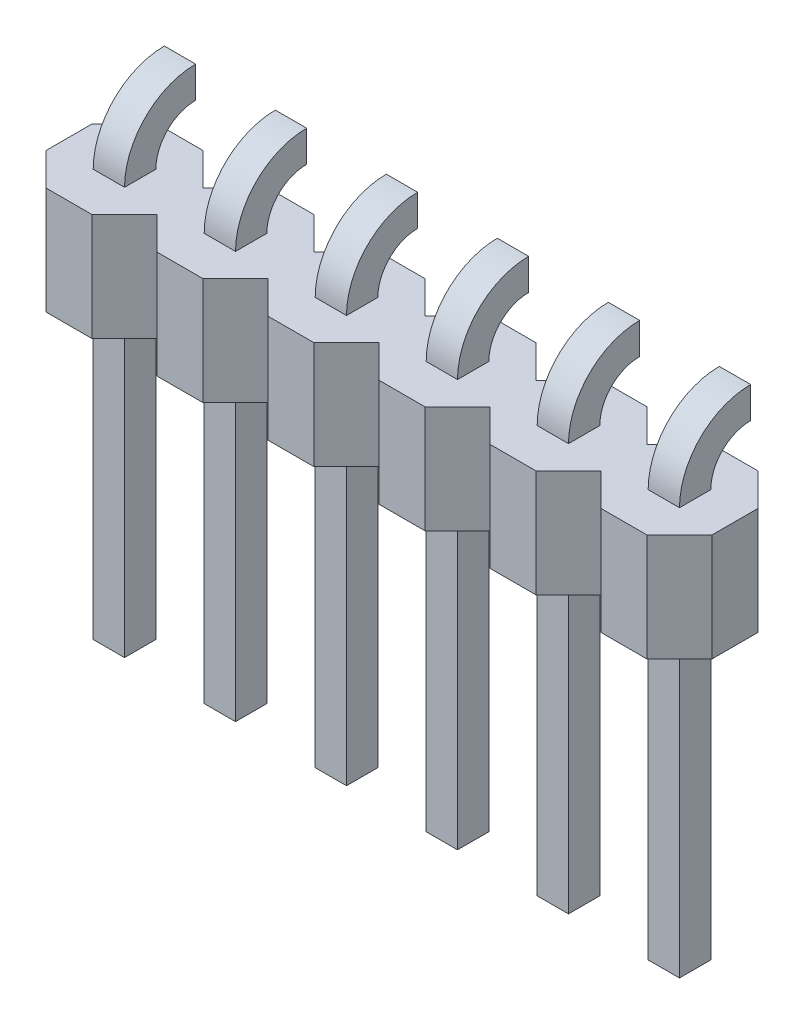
ISO-10303-21;
HEADER;
FILE_DESCRIPTION(('STEP AP214'),'2;1');
FILE_NAME('part.step','',(''),(''),'','','');
FILE_SCHEMA(('AUTOMOTIVE_DESIGN { 1 0 10303 214 1 1 1 1 }'));
ENDSEC;
DATA;
#1=APPLICATION_CONTEXT('core data for automotive mechanical design processes');
#2=APPLICATION_PROTOCOL_DEFINITION('international standard','automotive_design',2000,#1);
#3=PRODUCT_CONTEXT('',#1,'mechanical');
#4=PRODUCT('Part','Part','',(#3));
#5=PRODUCT_RELATED_PRODUCT_CATEGORY('part','',(#4));
#6=PRODUCT_DEFINITION_FORMATION('','',#4);
#7=PRODUCT_DEFINITION_CONTEXT('part definition',#1,'design');
#8=PRODUCT_DEFINITION('design','',#6,#7);
#9=PRODUCT_DEFINITION_SHAPE('','',#8);
#10=(LENGTH_UNIT() NAMED_UNIT(*) SI_UNIT(.MILLI.,.METRE.));
#11=(NAMED_UNIT(*) PLANE_ANGLE_UNIT() SI_UNIT($,.RADIAN.));
#12=(NAMED_UNIT(*) SI_UNIT($,.STERADIAN.) SOLID_ANGLE_UNIT());
#13=UNCERTAINTY_MEASURE_WITH_UNIT(LENGTH_MEASURE(1.E-05),#10,'distance_accuracy_value','');
#14=(GEOMETRIC_REPRESENTATION_CONTEXT(3) GLOBAL_UNCERTAINTY_ASSIGNED_CONTEXT((#13)) GLOBAL_UNIT_ASSIGNED_CONTEXT((#10,
#11,#12)) REPRESENTATION_CONTEXT('',''));
#15=CARTESIAN_POINT('',(0.,0.,0.));
#16=DIRECTION('',(0.,0.,1.));
#17=DIRECTION('',(1.,0.,0.));
#18=AXIS2_PLACEMENT_3D('',#15,#16,#17);
#19=CARTESIAN_POINT('',(0.,9.1,0.));
#20=DIRECTION('',(0.,-1.,0.));
#21=DIRECTION('',(0.,0.,-1.));
#22=AXIS2_PLACEMENT_3D('',#19,#20,#21);
#23=PLANE('',#22);
#24=DIRECTION('',(0.,0.,1.));
#25=VECTOR('',#24,1.);
#26=CARTESIAN_POINT('',(2.13,9.1,-0.349999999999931));
#27=LINE('',#26,#25);
#28=CARTESIAN_POINT('',(2.13,9.1,-0.349999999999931));
#29=VERTEX_POINT('',#28);
#30=CARTESIAN_POINT('',(2.13,9.1,0.35000000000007));
#31=VERTEX_POINT('',#30);
#32=EDGE_CURVE('E620',#29,#31,#27,.T.);
#33=ORIENTED_EDGE('',*,*,#32,.F.);
#34=DIRECTION('',(-1.,0.,0.));
#35=VECTOR('',#34,1.);
#36=CARTESIAN_POINT('',(2.83,9.1,-0.349999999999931));
#37=LINE('',#36,#35);
#38=CARTESIAN_POINT('',(2.83,9.1,-0.349999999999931));
#39=VERTEX_POINT('',#38);
#40=EDGE_CURVE('E632',#39,#29,#37,.T.);
#41=ORIENTED_EDGE('',*,*,#40,.F.);
#42=DIRECTION('',(0.,0.,-1.));
#43=VECTOR('',#42,1.);
#44=CARTESIAN_POINT('',(2.83,9.1,0.350000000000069));
#45=LINE('',#44,#43);
#46=CARTESIAN_POINT('',(2.83,9.1,0.350000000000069));
#47=VERTEX_POINT('',#46);
#48=EDGE_CURVE('E628',#47,#39,#45,.T.);
#49=ORIENTED_EDGE('',*,*,#48,.F.);
#50=DIRECTION('',(1.,0.,0.));
#51=VECTOR('',#50,1.);
#52=CARTESIAN_POINT('',(2.13,9.1,0.350000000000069));
#53=LINE('',#52,#51);
#54=EDGE_CURVE('E624',#31,#47,#53,.T.);
#55=ORIENTED_EDGE('',*,*,#54,.F.);
#56=EDGE_LOOP('',(#33,#41,#49,#55));
#57=FACE_BOUND('',#56,.T.);
#58=DIRECTION('',(0.,0.,1.));
#59=VECTOR('',#58,1.);
#60=CARTESIAN_POINT('',(7.09,9.1,-0.349999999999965));
#61=LINE('',#60,#59);
#62=CARTESIAN_POINT('',(7.09,9.1,-0.349999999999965));
#63=VERTEX_POINT('',#62);
#64=CARTESIAN_POINT('',(7.09,9.1,0.350000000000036));
#65=VERTEX_POINT('',#64);
#66=EDGE_CURVE('E716',#63,#65,#61,.T.);
#67=ORIENTED_EDGE('',*,*,#66,.F.);
#68=DIRECTION('',(-1.,0.,0.));
#69=VECTOR('',#68,1.);
#70=CARTESIAN_POINT('',(7.79,9.1,-0.349999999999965));
#71=LINE('',#70,#69);
#72=CARTESIAN_POINT('',(7.79,9.1,-0.349999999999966));
#73=VERTEX_POINT('',#72);
#74=EDGE_CURVE('E728',#73,#63,#71,.T.);
#75=ORIENTED_EDGE('',*,*,#74,.F.);
#76=DIRECTION('',(0.,0.,-1.));
#77=VECTOR('',#76,1.);
#78=CARTESIAN_POINT('',(7.79,9.1,0.350000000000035));
#79=LINE('',#78,#77);
#80=CARTESIAN_POINT('',(7.79,9.1,0.350000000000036));
#81=VERTEX_POINT('',#80);
#82=EDGE_CURVE('E724',#81,#73,#79,.T.);
#83=ORIENTED_EDGE('',*,*,#82,.F.);
#84=DIRECTION('',(1.,0.,0.));
#85=VECTOR('',#84,1.);
#86=CARTESIAN_POINT('',(7.09,9.1,0.350000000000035));
#87=LINE('',#86,#85);
#88=EDGE_CURVE('E720',#65,#81,#87,.T.);
#89=ORIENTED_EDGE('',*,*,#88,.F.);
#90=EDGE_LOOP('',(#67,#75,#83,#89));
#91=FACE_BOUND('',#90,.T.);
#92=DIRECTION('',(0.,0.,1.));
#93=VECTOR('',#92,1.);
#94=CARTESIAN_POINT('',(12.05,9.1,-0.35));
#95=LINE('',#94,#93);
#96=CARTESIAN_POINT('',(12.05,9.1,-0.35));
#97=VERTEX_POINT('',#96);
#98=CARTESIAN_POINT('',(12.05,9.1,0.350000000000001));
#99=VERTEX_POINT('',#98);
#100=EDGE_CURVE('E812',#97,#99,#95,.T.);
#101=ORIENTED_EDGE('',*,*,#100,.F.);
#102=DIRECTION('',(-1.,0.,0.));
#103=VECTOR('',#102,1.);
#104=CARTESIAN_POINT('',(12.75,9.1,-0.35));
#105=LINE('',#104,#103);
#106=CARTESIAN_POINT('',(12.75,9.1,-0.35));
#107=VERTEX_POINT('',#106);
#108=EDGE_CURVE('E824',#107,#97,#105,.T.);
#109=ORIENTED_EDGE('',*,*,#108,.F.);
#110=DIRECTION('',(0.,0.,-1.));
#111=VECTOR('',#110,1.);
#112=CARTESIAN_POINT('',(12.75,9.1,0.35));
#113=LINE('',#112,#111);
#114=CARTESIAN_POINT('',(12.75,9.1,0.350000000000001));
#115=VERTEX_POINT('',#114);
#116=EDGE_CURVE('E820',#115,#107,#113,.T.);
#117=ORIENTED_EDGE('',*,*,#116,.F.);
#118=DIRECTION('',(1.,0.,0.));
#119=VECTOR('',#118,1.);
#120=CARTESIAN_POINT('',(12.05,9.1,0.35));
#121=LINE('',#120,#119);
#122=EDGE_CURVE('E816',#99,#115,#121,.T.);
#123=ORIENTED_EDGE('',*,*,#122,.F.);
#124=EDGE_LOOP('',(#101,#109,#117,#123));
#125=FACE_BOUND('',#124,.T.);
#126=DIRECTION('',(0.,0.,-1.));
#127=VECTOR('',#126,1.);
#128=CARTESIAN_POINT('',(13.64,9.1,0.));
#129=LINE('',#128,#127);
#130=CARTESIAN_POINT('',(13.64,9.1,0.513624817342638));
#131=VERTEX_POINT('',#130);
#132=CARTESIAN_POINT('',(13.64,9.1,-0.513624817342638));
#133=VERTEX_POINT('',#132);
#134=EDGE_CURVE('E1064',#131,#133,#129,.T.);
#135=ORIENTED_EDGE('',*,*,#134,.T.);
#136=DIRECTION('',(-0.707106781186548,0.,-0.707106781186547));
#137=VECTOR('',#136,1.);
#138=CARTESIAN_POINT('',(7.07681240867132,9.1,-7.07681240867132));
#139=LINE('',#138,#137);
#140=CARTESIAN_POINT('',(12.9136248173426,9.1,-1.24));
#141=VERTEX_POINT('',#140);
#142=EDGE_CURVE('E1252',#133,#141,#139,.T.);
#143=ORIENTED_EDGE('',*,*,#142,.T.);
#144=DIRECTION('',(-1.,0.,0.));
#145=VECTOR('',#144,1.);
#146=CARTESIAN_POINT('',(0.,9.1,-1.24));
#147=LINE('',#146,#145);
#148=CARTESIAN_POINT('',(11.8863751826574,9.1,-1.24));
#149=VERTEX_POINT('',#148);
#150=EDGE_CURVE('E1256',#141,#149,#147,.T.);
#151=ORIENTED_EDGE('',*,*,#150,.T.);
#152=DIRECTION('',(-0.707106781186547,0.,0.707106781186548));
#153=VECTOR('',#152,1.);
#154=CARTESIAN_POINT('',(5.32318759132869,9.1,5.32318759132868));
#155=LINE('',#154,#153);
#156=CARTESIAN_POINT('',(11.16,9.1,-0.513624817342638));
#157=VERTEX_POINT('',#156);
#158=EDGE_CURVE('E1260',#149,#157,#155,.T.);
#159=ORIENTED_EDGE('',*,*,#158,.T.);
#160=DIRECTION('',(-0.707106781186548,0.,-0.707106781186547));
#161=VECTOR('',#160,1.);
#162=CARTESIAN_POINT('',(5.83681240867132,9.1,-5.83681240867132));
#163=LINE('',#162,#161);
#164=CARTESIAN_POINT('',(10.4336248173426,9.1,-1.24));
#165=VERTEX_POINT('',#164);
#166=EDGE_CURVE('E1264',#157,#165,#163,.T.);
#167=ORIENTED_EDGE('',*,*,#166,.T.);
#168=DIRECTION('',(-1.,0.,0.));
#169=VECTOR('',#168,1.);
#170=CARTESIAN_POINT('',(0.,9.1,-1.24));
#171=LINE('',#170,#169);
#172=CARTESIAN_POINT('',(9.40637518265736,9.1,-1.24));
#173=VERTEX_POINT('',#172);
#174=EDGE_CURVE('E1268',#165,#173,#171,.T.);
#175=ORIENTED_EDGE('',*,*,#174,.T.);
#176=DIRECTION('',(-0.707106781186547,0.,0.707106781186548));
#177=VECTOR('',#176,1.);
#178=CARTESIAN_POINT('',(4.08318759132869,9.1,4.08318759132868));
#179=LINE('',#178,#177);
#180=CARTESIAN_POINT('',(8.68,9.1,-0.513624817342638));
#181=VERTEX_POINT('',#180);
#182=EDGE_CURVE('E1272',#173,#181,#179,.T.);
#183=ORIENTED_EDGE('',*,*,#182,.T.);
#184=DIRECTION('',(-0.707106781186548,0.,-0.707106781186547));
#185=VECTOR('',#184,1.);
#186=CARTESIAN_POINT('',(4.59681240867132,9.1,-4.59681240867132));
#187=LINE('',#186,#185);
#188=CARTESIAN_POINT('',(7.95362481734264,9.1,-1.24));
#189=VERTEX_POINT('',#188);
#190=EDGE_CURVE('E1276',#181,#189,#187,.T.);
#191=ORIENTED_EDGE('',*,*,#190,.T.);
#192=DIRECTION('',(-1.,0.,0.));
#193=VECTOR('',#192,1.);
#194=CARTESIAN_POINT('',(0.,9.1,-1.24));
#195=LINE('',#194,#193);
#196=CARTESIAN_POINT('',(6.92637518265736,9.1,-1.24));
#197=VERTEX_POINT('',#196);
#198=EDGE_CURVE('E1280',#189,#197,#195,.T.);
#199=ORIENTED_EDGE('',*,*,#198,.T.);
#200=DIRECTION('',(-0.707106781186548,0.,0.707106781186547));
#201=VECTOR('',#200,1.);
#202=CARTESIAN_POINT('',(2.84318759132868,9.1,2.84318759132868));
#203=LINE('',#202,#201);
#204=CARTESIAN_POINT('',(6.2,9.1,-0.513624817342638));
#205=VERTEX_POINT('',#204);
#206=EDGE_CURVE('E1284',#197,#205,#203,.T.);
#207=ORIENTED_EDGE('',*,*,#206,.T.);
#208=DIRECTION('',(-0.707106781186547,0.,-0.707106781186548));
#209=VECTOR('',#208,1.);
#210=CARTESIAN_POINT('',(3.35681240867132,9.1,-3.35681240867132));
#211=LINE('',#210,#209);
#212=CARTESIAN_POINT('',(5.47362481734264,9.1,-1.24));
#213=VERTEX_POINT('',#212);
#214=EDGE_CURVE('E1288',#205,#213,#211,.T.);
#215=ORIENTED_EDGE('',*,*,#214,.T.);
#216=DIRECTION('',(-1.,0.,0.));
#217=VECTOR('',#216,1.);
#218=CARTESIAN_POINT('',(0.,9.1,-1.24));
#219=LINE('',#218,#217);
#220=CARTESIAN_POINT('',(4.44637518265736,9.1,-1.24));
#221=VERTEX_POINT('',#220);
#222=EDGE_CURVE('E1292',#213,#221,#219,.T.);
#223=ORIENTED_EDGE('',*,*,#222,.T.);
#224=DIRECTION('',(-0.707106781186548,0.,0.707106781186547));
#225=VECTOR('',#224,1.);
#226=CARTESIAN_POINT('',(1.60318759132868,9.1,1.60318759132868));
#227=LINE('',#226,#225);
#228=CARTESIAN_POINT('',(3.72,9.1,-0.513624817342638));
#229=VERTEX_POINT('',#228);
#230=EDGE_CURVE('E1296',#221,#229,#227,.T.);
#231=ORIENTED_EDGE('',*,*,#230,.T.);
#232=DIRECTION('',(-0.707106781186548,0.,-0.707106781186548));
#233=VECTOR('',#232,1.);
#234=CARTESIAN_POINT('',(2.11681240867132,9.1,-2.11681240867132));
#235=LINE('',#234,#233);
#236=CARTESIAN_POINT('',(2.99362481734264,9.1,-1.24));
#237=VERTEX_POINT('',#236);
#238=EDGE_CURVE('E1300',#229,#237,#235,.T.);
#239=ORIENTED_EDGE('',*,*,#238,.T.);
#240=DIRECTION('',(-1.,0.,0.));
#241=VECTOR('',#240,1.);
#242=CARTESIAN_POINT('',(0.,9.1,-1.24));
#243=LINE('',#242,#241);
#244=CARTESIAN_POINT('',(1.96637518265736,9.1,-1.24));
#245=VERTEX_POINT('',#244);
#246=EDGE_CURVE('E1304',#237,#245,#243,.T.);
#247=ORIENTED_EDGE('',*,*,#246,.T.);
#248=DIRECTION('',(-0.707106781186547,0.,0.707106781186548));
#249=VECTOR('',#248,1.);
#250=CARTESIAN_POINT('',(0.363187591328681,9.1,0.363187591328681));
#251=LINE('',#250,#249);
#252=CARTESIAN_POINT('',(1.24,9.1,-0.513624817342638));
#253=VERTEX_POINT('',#252);
#254=EDGE_CURVE('E1308',#245,#253,#251,.T.);
#255=ORIENTED_EDGE('',*,*,#254,.T.);
#256=DIRECTION('',(-0.707106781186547,0.,-0.707106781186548));
#257=VECTOR('',#256,1.);
#258=CARTESIAN_POINT('',(0.876812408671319,9.1,-0.876812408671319));
#259=LINE('',#258,#257);
#260=CARTESIAN_POINT('',(0.513624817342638,9.1,-1.24));
#261=VERTEX_POINT('',#260);
#262=EDGE_CURVE('E1312',#253,#261,#259,.T.);
#263=ORIENTED_EDGE('',*,*,#262,.T.);
#264=DIRECTION('',(-1.,0.,0.));
#265=VECTOR('',#264,1.);
#266=CARTESIAN_POINT('',(0.,9.1,-1.24));
#267=LINE('',#266,#265);
#268=CARTESIAN_POINT('',(-0.513624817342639,9.1,-1.24));
#269=VERTEX_POINT('',#268);
#270=EDGE_CURVE('E1316',#261,#269,#267,.T.);
#271=ORIENTED_EDGE('',*,*,#270,.T.);
#272=DIRECTION('',(-0.707106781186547,0.,0.707106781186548));
#273=VECTOR('',#272,1.);
#274=CARTESIAN_POINT('',(-0.876812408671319,9.1,-0.876812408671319));
#275=LINE('',#274,#273);
#276=CARTESIAN_POINT('',(-1.24,9.1,-0.513624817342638));
#277=VERTEX_POINT('',#276);
#278=EDGE_CURVE('E1320',#269,#277,#275,.T.);
#279=ORIENTED_EDGE('',*,*,#278,.T.);
#280=DIRECTION('',(0.,0.,1.));
#281=VECTOR('',#280,1.);
#282=CARTESIAN_POINT('',(-1.24,9.1,0.));
#283=LINE('',#282,#281);
#284=CARTESIAN_POINT('',(-1.24,9.1,0.513624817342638));
#285=VERTEX_POINT('',#284);
#286=EDGE_CURVE('E1324',#277,#285,#283,.T.);
#287=ORIENTED_EDGE('',*,*,#286,.T.);
#288=DIRECTION('',(0.707106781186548,0.,0.707106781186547));
#289=VECTOR('',#288,1.);
#290=CARTESIAN_POINT('',(-0.876812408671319,9.1,0.876812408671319));
#291=LINE('',#290,#289);
#292=CARTESIAN_POINT('',(-0.513624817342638,9.1,1.24));
#293=VERTEX_POINT('',#292);
#294=EDGE_CURVE('E1328',#285,#293,#291,.T.);
#295=ORIENTED_EDGE('',*,*,#294,.T.);
#296=DIRECTION('',(1.,0.,0.));
#297=VECTOR('',#296,1.);
#298=CARTESIAN_POINT('',(0.,9.1,1.24));
#299=LINE('',#298,#297);
#300=CARTESIAN_POINT('',(0.513624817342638,9.1,1.24));
#301=VERTEX_POINT('',#300);
#302=EDGE_CURVE('E1332',#293,#301,#299,.T.);
#303=ORIENTED_EDGE('',*,*,#302,.T.);
#304=DIRECTION('',(0.707106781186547,0.,-0.707106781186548));
#305=VECTOR('',#304,1.);
#306=CARTESIAN_POINT('',(0.876812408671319,9.1,0.876812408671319));
#307=LINE('',#306,#305);
#308=CARTESIAN_POINT('',(1.24,9.1,0.513624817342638));
#309=VERTEX_POINT('',#308);
#310=EDGE_CURVE('E1336',#301,#309,#307,.T.);
#311=ORIENTED_EDGE('',*,*,#310,.T.);
#312=DIRECTION('',(0.707106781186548,0.,0.707106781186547));
#313=VECTOR('',#312,1.);
#314=CARTESIAN_POINT('',(0.363187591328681,9.1,-0.363187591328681));
#315=LINE('',#314,#313);
#316=CARTESIAN_POINT('',(1.96637518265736,9.1,1.24));
#317=VERTEX_POINT('',#316);
#318=EDGE_CURVE('E1340',#309,#317,#315,.T.);
#319=ORIENTED_EDGE('',*,*,#318,.T.);
#320=DIRECTION('',(1.,0.,0.));
#321=VECTOR('',#320,1.);
#322=CARTESIAN_POINT('',(0.,9.1,1.24));
#323=LINE('',#322,#321);
#324=CARTESIAN_POINT('',(2.99362481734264,9.1,1.24));
#325=VERTEX_POINT('',#324);
#326=EDGE_CURVE('E1344',#317,#325,#323,.T.);
#327=ORIENTED_EDGE('',*,*,#326,.T.);
#328=DIRECTION('',(0.707106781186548,0.,-0.707106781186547));
#329=VECTOR('',#328,1.);
#330=CARTESIAN_POINT('',(2.11681240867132,9.1,2.11681240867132));
#331=LINE('',#330,#329);
#332=CARTESIAN_POINT('',(3.72,9.1,0.513624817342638));
#333=VERTEX_POINT('',#332);
#334=EDGE_CURVE('E1348',#325,#333,#331,.T.);
#335=ORIENTED_EDGE('',*,*,#334,.T.);
#336=DIRECTION('',(0.707106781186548,0.,0.707106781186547));
#337=VECTOR('',#336,1.);
#338=CARTESIAN_POINT('',(1.60318759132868,9.1,-1.60318759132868));
#339=LINE('',#338,#337);
#340=CARTESIAN_POINT('',(4.44637518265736,9.1,1.24));
#341=VERTEX_POINT('',#340);
#342=EDGE_CURVE('E1352',#333,#341,#339,.T.);
#343=ORIENTED_EDGE('',*,*,#342,.T.);
#344=DIRECTION('',(1.,0.,0.));
#345=VECTOR('',#344,1.);
#346=CARTESIAN_POINT('',(0.,9.1,1.24));
#347=LINE('',#346,#345);
#348=CARTESIAN_POINT('',(5.47362481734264,9.1,1.24));
#349=VERTEX_POINT('',#348);
#350=EDGE_CURVE('E1356',#341,#349,#347,.T.);
#351=ORIENTED_EDGE('',*,*,#350,.T.);
#352=DIRECTION('',(0.707106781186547,0.,-0.707106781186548));
#353=VECTOR('',#352,1.);
#354=CARTESIAN_POINT('',(3.35681240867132,9.1,3.35681240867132));
#355=LINE('',#354,#353);
#356=CARTESIAN_POINT('',(6.2,9.1,0.513624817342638));
#357=VERTEX_POINT('',#356);
#358=EDGE_CURVE('E1360',#349,#357,#355,.T.);
#359=ORIENTED_EDGE('',*,*,#358,.T.);
#360=DIRECTION('',(0.707106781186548,0.,0.707106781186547));
#361=VECTOR('',#360,1.);
#362=CARTESIAN_POINT('',(2.84318759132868,9.1,-2.84318759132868));
#363=LINE('',#362,#361);
#364=CARTESIAN_POINT('',(6.92637518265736,9.1,1.24));
#365=VERTEX_POINT('',#364);
#366=EDGE_CURVE('E1364',#357,#365,#363,.T.);
#367=ORIENTED_EDGE('',*,*,#366,.T.);
#368=DIRECTION('',(1.,0.,0.));
#369=VECTOR('',#368,1.);
#370=CARTESIAN_POINT('',(0.,9.1,1.24));
#371=LINE('',#370,#369);
#372=CARTESIAN_POINT('',(7.95362481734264,9.1,1.24));
#373=VERTEX_POINT('',#372);
#374=EDGE_CURVE('E1368',#365,#373,#371,.T.);
#375=ORIENTED_EDGE('',*,*,#374,.T.);
#376=DIRECTION('',(0.707106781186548,0.,-0.707106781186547));
#377=VECTOR('',#376,1.);
#378=CARTESIAN_POINT('',(4.59681240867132,9.1,4.59681240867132));
#379=LINE('',#378,#377);
#380=CARTESIAN_POINT('',(8.68,9.1,0.513624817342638));
#381=VERTEX_POINT('',#380);
#382=EDGE_CURVE('E1372',#373,#381,#379,.T.);
#383=ORIENTED_EDGE('',*,*,#382,.T.);
#384=DIRECTION('',(0.707106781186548,0.,0.707106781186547));
#385=VECTOR('',#384,1.);
#386=CARTESIAN_POINT('',(4.08318759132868,9.1,-4.08318759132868));
#387=LINE('',#386,#385);
#388=CARTESIAN_POINT('',(9.40637518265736,9.1,1.24));
#389=VERTEX_POINT('',#388);
#390=EDGE_CURVE('E1376',#381,#389,#387,.T.);
#391=ORIENTED_EDGE('',*,*,#390,.T.);
#392=DIRECTION('',(1.,0.,0.));
#393=VECTOR('',#392,1.);
#394=CARTESIAN_POINT('',(0.,9.1,1.24));
#395=LINE('',#394,#393);
#396=CARTESIAN_POINT('',(10.4336248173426,9.1,1.24));
#397=VERTEX_POINT('',#396);
#398=EDGE_CURVE('E1380',#389,#397,#395,.T.);
#399=ORIENTED_EDGE('',*,*,#398,.T.);
#400=DIRECTION('',(0.707106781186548,0.,-0.707106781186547));
#401=VECTOR('',#400,1.);
#402=CARTESIAN_POINT('',(5.83681240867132,9.1,5.83681240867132));
#403=LINE('',#402,#401);
#404=CARTESIAN_POINT('',(11.16,9.1,0.513624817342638));
#405=VERTEX_POINT('',#404);
#406=EDGE_CURVE('E1384',#397,#405,#403,.T.);
#407=ORIENTED_EDGE('',*,*,#406,.T.);
#408=DIRECTION('',(0.707106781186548,0.,0.707106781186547));
#409=VECTOR('',#408,1.);
#410=CARTESIAN_POINT('',(5.32318759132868,9.1,-5.32318759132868));
#411=LINE('',#410,#409);
#412=CARTESIAN_POINT('',(11.8863751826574,9.1,1.24));
#413=VERTEX_POINT('',#412);
#414=EDGE_CURVE('E1388',#405,#413,#411,.T.);
#415=ORIENTED_EDGE('',*,*,#414,.T.);
#416=DIRECTION('',(1.,0.,0.));
#417=VECTOR('',#416,1.);
#418=CARTESIAN_POINT('',(0.,9.1,1.24));
#419=LINE('',#418,#417);
#420=CARTESIAN_POINT('',(12.9136248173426,9.1,1.24));
#421=VERTEX_POINT('',#420);
#422=EDGE_CURVE('E1392',#413,#421,#419,.T.);
#423=ORIENTED_EDGE('',*,*,#422,.T.);
#424=DIRECTION('',(0.707106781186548,0.,-0.707106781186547));
#425=VECTOR('',#424,1.);
#426=CARTESIAN_POINT('',(7.07681240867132,9.1,7.07681240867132));
#427=LINE('',#426,#425);
#428=EDGE_CURVE('E1070',#421,#131,#427,.T.);
#429=ORIENTED_EDGE('',*,*,#428,.T.);
#430=EDGE_LOOP('',(#135,#143,#151,#159,#167,#175,#183,#191,#199,#207,#215,#223,#231,#239,#247,
#255,#263,#271,#279,#287,#295,#303,#311,#319,#327,#335,#343,#351,#359,#367,#375,#383,#391,#399,
#407,#415,#423,#429));
#431=FACE_BOUND('',#430,.T.);
#432=DIRECTION('',(0.,0.,1.));
#433=VECTOR('',#432,1.);
#434=CARTESIAN_POINT('',(9.57,9.1,-0.349999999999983));
#435=LINE('',#434,#433);
#436=CARTESIAN_POINT('',(9.57,9.1,-0.349999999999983));
#437=VERTEX_POINT('',#436);
#438=CARTESIAN_POINT('',(9.57,9.1,0.350000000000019));
#439=VERTEX_POINT('',#438);
#440=EDGE_CURVE('E764',#437,#439,#435,.T.);
#441=ORIENTED_EDGE('',*,*,#440,.F.);
#442=DIRECTION('',(-1.,0.,0.));
#443=VECTOR('',#442,1.);
#444=CARTESIAN_POINT('',(10.27,9.1,-0.349999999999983));
#445=LINE('',#444,#443);
#446=CARTESIAN_POINT('',(10.27,9.1,-0.349999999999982));
#447=VERTEX_POINT('',#446);
#448=EDGE_CURVE('E776',#447,#437,#445,.T.);
#449=ORIENTED_EDGE('',*,*,#448,.F.);
#450=DIRECTION('',(0.,0.,-1.));
#451=VECTOR('',#450,1.);
#452=CARTESIAN_POINT('',(10.27,9.1,0.350000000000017));
#453=LINE('',#452,#451);
#454=CARTESIAN_POINT('',(10.27,9.1,0.350000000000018));
#455=VERTEX_POINT('',#454);
#456=EDGE_CURVE('E772',#455,#447,#453,.T.);
#457=ORIENTED_EDGE('',*,*,#456,.F.);
#458=DIRECTION('',(1.,0.,0.));
#459=VECTOR('',#458,1.);
#460=CARTESIAN_POINT('',(9.57,9.1,0.350000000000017));
#461=LINE('',#460,#459);
#462=EDGE_CURVE('E768',#439,#455,#461,.T.);
#463=ORIENTED_EDGE('',*,*,#462,.F.);
#464=EDGE_LOOP('',(#441,#449,#457,#463));
#465=FACE_BOUND('',#464,.T.);
#466=DIRECTION('',(0.,0.,1.));
#467=VECTOR('',#466,1.);
#468=CARTESIAN_POINT('',(4.61,9.1,-0.349999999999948));
#469=LINE('',#468,#467);
#470=CARTESIAN_POINT('',(4.61,9.1,-0.349999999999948));
#471=VERTEX_POINT('',#470);
#472=CARTESIAN_POINT('',(4.61,9.1,0.350000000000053));
#473=VERTEX_POINT('',#472);
#474=EDGE_CURVE('E668',#471,#473,#469,.T.);
#475=ORIENTED_EDGE('',*,*,#474,.F.);
#476=DIRECTION('',(-1.,0.,0.));
#477=VECTOR('',#476,1.);
#478=CARTESIAN_POINT('',(5.31,9.1,-0.349999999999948));
#479=LINE('',#478,#477);
#480=CARTESIAN_POINT('',(5.31,9.1,-0.349999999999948));
#481=VERTEX_POINT('',#480);
#482=EDGE_CURVE('E680',#481,#471,#479,.T.);
#483=ORIENTED_EDGE('',*,*,#482,.F.);
#484=DIRECTION('',(0.,0.,-1.));
#485=VECTOR('',#484,1.);
#486=CARTESIAN_POINT('',(5.31,9.1,0.350000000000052));
#487=LINE('',#486,#485);
#488=CARTESIAN_POINT('',(5.31,9.1,0.350000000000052));
#489=VERTEX_POINT('',#488);
#490=EDGE_CURVE('E676',#489,#481,#487,.T.);
#491=ORIENTED_EDGE('',*,*,#490,.F.);
#492=DIRECTION('',(1.,0.,0.));
#493=VECTOR('',#492,1.);
#494=CARTESIAN_POINT('',(4.61,9.1,0.350000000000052));
#495=LINE('',#494,#493);
#496=EDGE_CURVE('E672',#473,#489,#495,.T.);
#497=ORIENTED_EDGE('',*,*,#496,.F.);
#498=EDGE_LOOP('',(#475,#483,#491,#497));
#499=FACE_BOUND('',#498,.T.);
#500=DIRECTION('',(0.,0.,1.));
#501=VECTOR('',#500,1.);
#502=CARTESIAN_POINT('',(-0.349999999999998,9.1,-0.349999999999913));
#503=LINE('',#502,#501);
#504=CARTESIAN_POINT('',(-0.349999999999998,9.1,-0.349999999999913));
#505=VERTEX_POINT('',#504);
#506=CARTESIAN_POINT('',(-0.35,9.1,0.350000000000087));
#507=VERTEX_POINT('',#506);
#508=EDGE_CURVE('E573',#505,#507,#503,.T.);
#509=ORIENTED_EDGE('',*,*,#508,.F.);
#510=DIRECTION('',(-1.,0.,0.));
#511=VECTOR('',#510,1.);
#512=CARTESIAN_POINT('',(0.350000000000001,9.1,-0.349999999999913));
#513=LINE('',#512,#511);
#514=CARTESIAN_POINT('',(0.350000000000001,9.1,-0.349999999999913));
#515=VERTEX_POINT('',#514);
#516=EDGE_CURVE('E576',#515,#505,#513,.T.);
#517=ORIENTED_EDGE('',*,*,#516,.F.);
#518=DIRECTION('',(0.,0.,-1.));
#519=VECTOR('',#518,1.);
#520=CARTESIAN_POINT('',(0.350000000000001,9.1,0.350000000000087));
#521=LINE('',#520,#519);
#522=CARTESIAN_POINT('',(0.350000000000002,9.1,0.350000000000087));
#523=VERTEX_POINT('',#522);
#524=EDGE_CURVE('E64',#523,#515,#521,.T.);
#525=ORIENTED_EDGE('',*,*,#524,.F.);
#526=DIRECTION('',(1.,0.,0.));
#527=VECTOR('',#526,1.);
#528=CARTESIAN_POINT('',(-0.349999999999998,9.1,0.350000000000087));
#529=LINE('',#528,#527);
#530=EDGE_CURVE('E59',#507,#523,#529,.T.);
#531=ORIENTED_EDGE('',*,*,#530,.F.);
#532=EDGE_LOOP('',(#509,#517,#525,#531));
#533=FACE_BOUND('',#532,.T.);
#534=ADVANCED_FACE('F43',(#57,#91,#125,#431,#465,#499,#533),#23,.F.);
#535=CARTESIAN_POINT('',(0.,6.7,0.));
#536=DIRECTION('',(0.,1.,0.));
#537=DIRECTION('',(0.,0.,1.));
#538=AXIS2_PLACEMENT_3D('',#535,#536,#537);
#539=PLANE('',#538);
#540=DIRECTION('',(1.,0.,0.));
#541=VECTOR('',#540,1.);
#542=CARTESIAN_POINT('',(0.,6.7,-0.35));
#543=LINE('',#542,#541);
#544=CARTESIAN_POINT('',(7.09,6.7,-0.35));
#545=VERTEX_POINT('',#544);
#546=CARTESIAN_POINT('',(7.79,6.7,-0.35));
#547=VERTEX_POINT('',#546);
#548=EDGE_CURVE('E972',#545,#547,#543,.T.);
#549=ORIENTED_EDGE('',*,*,#548,.F.);
#550=DIRECTION('',(0.,0.,-1.));
#551=VECTOR('',#550,1.);
#552=CARTESIAN_POINT('',(7.09,6.7,0.));
#553=LINE('',#552,#551);
#554=CARTESIAN_POINT('',(7.09,6.7,0.35));
#555=VERTEX_POINT('',#554);
#556=EDGE_CURVE('E968',#555,#545,#553,.T.);
#557=ORIENTED_EDGE('',*,*,#556,.F.);
#558=DIRECTION('',(-1.,0.,0.));
#559=VECTOR('',#558,1.);
#560=CARTESIAN_POINT('',(0.,6.7,0.35));
#561=LINE('',#560,#559);
#562=CARTESIAN_POINT('',(7.79,6.7,0.35));
#563=VERTEX_POINT('',#562);
#564=EDGE_CURVE('E964',#563,#555,#561,.T.);
#565=ORIENTED_EDGE('',*,*,#564,.F.);
#566=DIRECTION('',(0.,0.,1.));
#567=VECTOR('',#566,1.);
#568=CARTESIAN_POINT('',(7.79,6.7,0.));
#569=LINE('',#568,#567);
#570=EDGE_CURVE('E960',#547,#563,#569,.T.);
#571=ORIENTED_EDGE('',*,*,#570,.F.);
#572=EDGE_LOOP('',(#549,#557,#565,#571));
#573=FACE_BOUND('',#572,.T.);
#574=DIRECTION('',(1.,0.,0.));
#575=VECTOR('',#574,1.);
#576=CARTESIAN_POINT('',(0.,6.7,-0.35));
#577=LINE('',#576,#575);
#578=CARTESIAN_POINT('',(2.13,6.7,-0.35));
#579=VERTEX_POINT('',#578);
#580=CARTESIAN_POINT('',(2.83,6.7,-0.35));
#581=VERTEX_POINT('',#580);
#582=EDGE_CURVE('E1060',#579,#581,#577,.T.);
#583=ORIENTED_EDGE('',*,*,#582,.F.);
#584=DIRECTION('',(0.,0.,-1.));
#585=VECTOR('',#584,1.);
#586=CARTESIAN_POINT('',(2.13,6.7,0.));
#587=LINE('',#586,#585);
#588=CARTESIAN_POINT('',(2.13,6.7,0.35));
#589=VERTEX_POINT('',#588);
#590=EDGE_CURVE('E1056',#589,#579,#587,.T.);
#591=ORIENTED_EDGE('',*,*,#590,.F.);
#592=DIRECTION('',(-1.,0.,0.));
#593=VECTOR('',#592,1.);
#594=CARTESIAN_POINT('',(0.,6.7,0.35));
#595=LINE('',#594,#593);
#596=CARTESIAN_POINT('',(2.83,6.7,0.35));
#597=VERTEX_POINT('',#596);
#598=EDGE_CURVE('E1052',#597,#589,#595,.T.);
#599=ORIENTED_EDGE('',*,*,#598,.F.);
#600=DIRECTION('',(0.,0.,1.));
#601=VECTOR('',#600,1.);
#602=CARTESIAN_POINT('',(2.83,6.7,0.));
#603=LINE('',#602,#601);
#604=EDGE_CURVE('E1048',#581,#597,#603,.T.);
#605=ORIENTED_EDGE('',*,*,#604,.F.);
#606=EDGE_LOOP('',(#583,#591,#599,#605));
#607=FACE_BOUND('',#606,.T.);
#608=DIRECTION('',(-1.,0.,0.));
#609=VECTOR('',#608,1.);
#610=CARTESIAN_POINT('',(0.,6.7,-0.35));
#611=LINE('',#610,#609);
#612=CARTESIAN_POINT('',(12.75,6.7,-0.35));
#613=VERTEX_POINT('',#612);
#614=CARTESIAN_POINT('',(12.05,6.7,-0.35));
#615=VERTEX_POINT('',#614);
#616=EDGE_CURVE('E1065',#613,#615,#611,.T.);
#617=ORIENTED_EDGE('',*,*,#616,.T.);
#618=DIRECTION('',(0.,0.,1.));
#619=VECTOR('',#618,1.);
#620=CARTESIAN_POINT('',(12.05,6.7,0.));
#621=LINE('',#620,#619);
#622=CARTESIAN_POINT('',(12.05,6.7,0.35));
#623=VERTEX_POINT('',#622);
#624=EDGE_CURVE('E1078',#615,#623,#621,.T.);
#625=ORIENTED_EDGE('',*,*,#624,.T.);
#626=DIRECTION('',(1.,0.,0.));
#627=VECTOR('',#626,1.);
#628=CARTESIAN_POINT('',(0.,6.7,0.35));
#629=LINE('',#628,#627);
#630=CARTESIAN_POINT('',(12.75,6.7,0.35));
#631=VERTEX_POINT('',#630);
#632=EDGE_CURVE('E1074',#623,#631,#629,.T.);
#633=ORIENTED_EDGE('',*,*,#632,.T.);
#634=DIRECTION('',(0.,0.,-1.));
#635=VECTOR('',#634,1.);
#636=CARTESIAN_POINT('',(12.75,6.7,0.));
#637=LINE('',#636,#635);
#638=EDGE_CURVE('E1069',#631,#613,#637,.T.);
#639=ORIENTED_EDGE('',*,*,#638,.T.);
#640=EDGE_LOOP('',(#617,#625,#633,#639));
#641=FACE_BOUND('',#640,.T.);
#642=DIRECTION('',(0.,0.,-1.));
#643=VECTOR('',#642,1.);
#644=CARTESIAN_POINT('',(13.64,6.7,0.));
#645=LINE('',#644,#643);
#646=CARTESIAN_POINT('',(13.64,6.7,0.513624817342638));
#647=VERTEX_POINT('',#646);
#648=CARTESIAN_POINT('',(13.64,6.7,-0.513624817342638));
#649=VERTEX_POINT('',#648);
#650=EDGE_CURVE('E1082',#647,#649,#645,.T.);
#651=ORIENTED_EDGE('',*,*,#650,.F.);
#652=DIRECTION('',(0.707106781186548,0.,-0.707106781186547));
#653=VECTOR('',#652,1.);
#654=CARTESIAN_POINT('',(7.07681240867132,6.7,7.07681240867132));
#655=LINE('',#654,#653);
#656=CARTESIAN_POINT('',(12.9136248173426,6.7,1.24));
#657=VERTEX_POINT('',#656);
#658=EDGE_CURVE('E1230',#657,#647,#655,.T.);
#659=ORIENTED_EDGE('',*,*,#658,.F.);
#660=DIRECTION('',(1.,0.,0.));
#661=VECTOR('',#660,1.);
#662=CARTESIAN_POINT('',(0.,6.7,1.24));
#663=LINE('',#662,#661);
#664=CARTESIAN_POINT('',(11.8863751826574,6.7,1.24));
#665=VERTEX_POINT('',#664);
#666=EDGE_CURVE('E1226',#665,#657,#663,.T.);
#667=ORIENTED_EDGE('',*,*,#666,.F.);
#668=DIRECTION('',(0.707106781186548,0.,0.707106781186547));
#669=VECTOR('',#668,1.);
#670=CARTESIAN_POINT('',(5.32318759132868,6.7,-5.32318759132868));
#671=LINE('',#670,#669);
#672=CARTESIAN_POINT('',(11.16,6.7,0.513624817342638));
#673=VERTEX_POINT('',#672);
#674=EDGE_CURVE('E1222',#673,#665,#671,.T.);
#675=ORIENTED_EDGE('',*,*,#674,.F.);
#676=DIRECTION('',(0.707106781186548,0.,-0.707106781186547));
#677=VECTOR('',#676,1.);
#678=CARTESIAN_POINT('',(5.83681240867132,6.7,5.83681240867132));
#679=LINE('',#678,#677);
#680=CARTESIAN_POINT('',(10.4336248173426,6.7,1.24));
#681=VERTEX_POINT('',#680);
#682=EDGE_CURVE('E1218',#681,#673,#679,.T.);
#683=ORIENTED_EDGE('',*,*,#682,.F.);
#684=DIRECTION('',(1.,0.,0.));
#685=VECTOR('',#684,1.);
#686=CARTESIAN_POINT('',(0.,6.7,1.24));
#687=LINE('',#686,#685);
#688=CARTESIAN_POINT('',(9.40637518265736,6.7,1.24));
#689=VERTEX_POINT('',#688);
#690=EDGE_CURVE('E1214',#689,#681,#687,.T.);
#691=ORIENTED_EDGE('',*,*,#690,.F.);
#692=DIRECTION('',(0.707106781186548,0.,0.707106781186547));
#693=VECTOR('',#692,1.);
#694=CARTESIAN_POINT('',(4.08318759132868,6.7,-4.08318759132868));
#695=LINE('',#694,#693);
#696=CARTESIAN_POINT('',(8.68,6.7,0.513624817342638));
#697=VERTEX_POINT('',#696);
#698=EDGE_CURVE('E1210',#697,#689,#695,.T.);
#699=ORIENTED_EDGE('',*,*,#698,.F.);
#700=DIRECTION('',(0.707106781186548,0.,-0.707106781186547));
#701=VECTOR('',#700,1.);
#702=CARTESIAN_POINT('',(4.59681240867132,6.7,4.59681240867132));
#703=LINE('',#702,#701);
#704=CARTESIAN_POINT('',(7.95362481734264,6.7,1.24));
#705=VERTEX_POINT('',#704);
#706=EDGE_CURVE('E1206',#705,#697,#703,.T.);
#707=ORIENTED_EDGE('',*,*,#706,.F.);
#708=DIRECTION('',(1.,0.,0.));
#709=VECTOR('',#708,1.);
#710=CARTESIAN_POINT('',(0.,6.7,1.24));
#711=LINE('',#710,#709);
#712=CARTESIAN_POINT('',(6.92637518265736,6.7,1.24));
#713=VERTEX_POINT('',#712);
#714=EDGE_CURVE('E1202',#713,#705,#711,.T.);
#715=ORIENTED_EDGE('',*,*,#714,.F.);
#716=DIRECTION('',(0.707106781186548,0.,0.707106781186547));
#717=VECTOR('',#716,1.);
#718=CARTESIAN_POINT('',(2.84318759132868,6.7,-2.84318759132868));
#719=LINE('',#718,#717);
#720=CARTESIAN_POINT('',(6.2,6.7,0.513624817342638));
#721=VERTEX_POINT('',#720);
#722=EDGE_CURVE('E1198',#721,#713,#719,.T.);
#723=ORIENTED_EDGE('',*,*,#722,.F.);
#724=DIRECTION('',(0.707106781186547,0.,-0.707106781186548));
#725=VECTOR('',#724,1.);
#726=CARTESIAN_POINT('',(3.35681240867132,6.7,3.35681240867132));
#727=LINE('',#726,#725);
#728=CARTESIAN_POINT('',(5.47362481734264,6.7,1.24));
#729=VERTEX_POINT('',#728);
#730=EDGE_CURVE('E1194',#729,#721,#727,.T.);
#731=ORIENTED_EDGE('',*,*,#730,.F.);
#732=DIRECTION('',(1.,0.,0.));
#733=VECTOR('',#732,1.);
#734=CARTESIAN_POINT('',(0.,6.7,1.24));
#735=LINE('',#734,#733);
#736=CARTESIAN_POINT('',(4.44637518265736,6.7,1.24));
#737=VERTEX_POINT('',#736);
#738=EDGE_CURVE('E1190',#737,#729,#735,.T.);
#739=ORIENTED_EDGE('',*,*,#738,.F.);
#740=DIRECTION('',(0.707106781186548,0.,0.707106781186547));
#741=VECTOR('',#740,1.);
#742=CARTESIAN_POINT('',(1.60318759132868,6.7,-1.60318759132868));
#743=LINE('',#742,#741);
#744=CARTESIAN_POINT('',(3.72,6.7,0.513624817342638));
#745=VERTEX_POINT('',#744);
#746=EDGE_CURVE('E1186',#745,#737,#743,.T.);
#747=ORIENTED_EDGE('',*,*,#746,.F.);
#748=DIRECTION('',(0.707106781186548,0.,-0.707106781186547));
#749=VECTOR('',#748,1.);
#750=CARTESIAN_POINT('',(2.11681240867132,6.7,2.11681240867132));
#751=LINE('',#750,#749);
#752=CARTESIAN_POINT('',(2.99362481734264,6.7,1.24));
#753=VERTEX_POINT('',#752);
#754=EDGE_CURVE('E1182',#753,#745,#751,.T.);
#755=ORIENTED_EDGE('',*,*,#754,.F.);
#756=DIRECTION('',(1.,0.,0.));
#757=VECTOR('',#756,1.);
#758=CARTESIAN_POINT('',(0.,6.7,1.24));
#759=LINE('',#758,#757);
#760=CARTESIAN_POINT('',(1.96637518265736,6.7,1.24));
#761=VERTEX_POINT('',#760);
#762=EDGE_CURVE('E1178',#761,#753,#759,.T.);
#763=ORIENTED_EDGE('',*,*,#762,.F.);
#764=DIRECTION('',(0.707106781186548,0.,0.707106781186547));
#765=VECTOR('',#764,1.);
#766=CARTESIAN_POINT('',(0.363187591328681,6.7,-0.363187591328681));
#767=LINE('',#766,#765);
#768=CARTESIAN_POINT('',(1.24,6.7,0.513624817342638));
#769=VERTEX_POINT('',#768);
#770=EDGE_CURVE('E1174',#769,#761,#767,.T.);
#771=ORIENTED_EDGE('',*,*,#770,.F.);
#772=DIRECTION('',(0.707106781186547,0.,-0.707106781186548));
#773=VECTOR('',#772,1.);
#774=CARTESIAN_POINT('',(0.876812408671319,6.7,0.876812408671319));
#775=LINE('',#774,#773);
#776=CARTESIAN_POINT('',(0.513624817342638,6.7,1.24));
#777=VERTEX_POINT('',#776);
#778=EDGE_CURVE('E1170',#777,#769,#775,.T.);
#779=ORIENTED_EDGE('',*,*,#778,.F.);
#780=DIRECTION('',(1.,0.,0.));
#781=VECTOR('',#780,1.);
#782=CARTESIAN_POINT('',(0.,6.7,1.24));
#783=LINE('',#782,#781);
#784=CARTESIAN_POINT('',(-0.513624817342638,6.7,1.24));
#785=VERTEX_POINT('',#784);
#786=EDGE_CURVE('E1166',#785,#777,#783,.T.);
#787=ORIENTED_EDGE('',*,*,#786,.F.);
#788=DIRECTION('',(0.707106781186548,0.,0.707106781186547));
#789=VECTOR('',#788,1.);
#790=CARTESIAN_POINT('',(-0.876812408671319,6.7,0.876812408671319));
#791=LINE('',#790,#789);
#792=CARTESIAN_POINT('',(-1.24,6.7,0.513624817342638));
#793=VERTEX_POINT('',#792);
#794=EDGE_CURVE('E1162',#793,#785,#791,.T.);
#795=ORIENTED_EDGE('',*,*,#794,.F.);
#796=DIRECTION('',(0.,0.,1.));
#797=VECTOR('',#796,1.);
#798=CARTESIAN_POINT('',(-1.24,6.7,0.));
#799=LINE('',#798,#797);
#800=CARTESIAN_POINT('',(-1.24,6.7,-0.513624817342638));
#801=VERTEX_POINT('',#800);
#802=EDGE_CURVE('E1158',#801,#793,#799,.T.);
#803=ORIENTED_EDGE('',*,*,#802,.F.);
#804=DIRECTION('',(-0.707106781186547,0.,0.707106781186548));
#805=VECTOR('',#804,1.);
#806=CARTESIAN_POINT('',(-0.876812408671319,6.7,-0.876812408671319));
#807=LINE('',#806,#805);
#808=CARTESIAN_POINT('',(-0.513624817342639,6.7,-1.24));
#809=VERTEX_POINT('',#808);
#810=EDGE_CURVE('E1154',#809,#801,#807,.T.);
#811=ORIENTED_EDGE('',*,*,#810,.F.);
#812=DIRECTION('',(-1.,0.,0.));
#813=VECTOR('',#812,1.);
#814=CARTESIAN_POINT('',(0.,6.7,-1.24));
#815=LINE('',#814,#813);
#816=CARTESIAN_POINT('',(0.513624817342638,6.7,-1.24));
#817=VERTEX_POINT('',#816);
#818=EDGE_CURVE('E1150',#817,#809,#815,.T.);
#819=ORIENTED_EDGE('',*,*,#818,.F.);
#820=DIRECTION('',(-0.707106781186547,0.,-0.707106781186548));
#821=VECTOR('',#820,1.);
#822=CARTESIAN_POINT('',(0.876812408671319,6.7,-0.876812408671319));
#823=LINE('',#822,#821);
#824=CARTESIAN_POINT('',(1.24,6.7,-0.513624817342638));
#825=VERTEX_POINT('',#824);
#826=EDGE_CURVE('E1146',#825,#817,#823,.T.);
#827=ORIENTED_EDGE('',*,*,#826,.F.);
#828=DIRECTION('',(-0.707106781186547,0.,0.707106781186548));
#829=VECTOR('',#828,1.);
#830=CARTESIAN_POINT('',(0.363187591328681,6.7,0.363187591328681));
#831=LINE('',#830,#829);
#832=CARTESIAN_POINT('',(1.96637518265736,6.7,-1.24));
#833=VERTEX_POINT('',#832);
#834=EDGE_CURVE('E1142',#833,#825,#831,.T.);
#835=ORIENTED_EDGE('',*,*,#834,.F.);
#836=DIRECTION('',(-1.,0.,0.));
#837=VECTOR('',#836,1.);
#838=CARTESIAN_POINT('',(0.,6.7,-1.24));
#839=LINE('',#838,#837);
#840=CARTESIAN_POINT('',(2.99362481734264,6.7,-1.24));
#841=VERTEX_POINT('',#840);
#842=EDGE_CURVE('E1138',#841,#833,#839,.T.);
#843=ORIENTED_EDGE('',*,*,#842,.F.);
#844=DIRECTION('',(-0.707106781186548,0.,-0.707106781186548));
#845=VECTOR('',#844,1.);
#846=CARTESIAN_POINT('',(2.11681240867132,6.7,-2.11681240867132));
#847=LINE('',#846,#845);
#848=CARTESIAN_POINT('',(3.72,6.7,-0.513624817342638));
#849=VERTEX_POINT('',#848);
#850=EDGE_CURVE('E1134',#849,#841,#847,.T.);
#851=ORIENTED_EDGE('',*,*,#850,.F.);
#852=DIRECTION('',(-0.707106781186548,0.,0.707106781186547));
#853=VECTOR('',#852,1.);
#854=CARTESIAN_POINT('',(1.60318759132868,6.7,1.60318759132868));
#855=LINE('',#854,#853);
#856=CARTESIAN_POINT('',(4.44637518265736,6.7,-1.24));
#857=VERTEX_POINT('',#856);
#858=EDGE_CURVE('E1130',#857,#849,#855,.T.);
#859=ORIENTED_EDGE('',*,*,#858,.F.);
#860=DIRECTION('',(-1.,0.,0.));
#861=VECTOR('',#860,1.);
#862=CARTESIAN_POINT('',(0.,6.7,-1.24));
#863=LINE('',#862,#861);
#864=CARTESIAN_POINT('',(5.47362481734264,6.7,-1.24));
#865=VERTEX_POINT('',#864);
#866=EDGE_CURVE('E1126',#865,#857,#863,.T.);
#867=ORIENTED_EDGE('',*,*,#866,.F.);
#868=DIRECTION('',(-0.707106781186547,0.,-0.707106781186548));
#869=VECTOR('',#868,1.);
#870=CARTESIAN_POINT('',(3.35681240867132,6.7,-3.35681240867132));
#871=LINE('',#870,#869);
#872=CARTESIAN_POINT('',(6.2,6.7,-0.513624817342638));
#873=VERTEX_POINT('',#872);
#874=EDGE_CURVE('E1122',#873,#865,#871,.T.);
#875=ORIENTED_EDGE('',*,*,#874,.F.);
#876=DIRECTION('',(-0.707106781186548,0.,0.707106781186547));
#877=VECTOR('',#876,1.);
#878=CARTESIAN_POINT('',(2.84318759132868,6.7,2.84318759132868));
#879=LINE('',#878,#877);
#880=CARTESIAN_POINT('',(6.92637518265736,6.7,-1.24));
#881=VERTEX_POINT('',#880);
#882=EDGE_CURVE('E1118',#881,#873,#879,.T.);
#883=ORIENTED_EDGE('',*,*,#882,.F.);
#884=DIRECTION('',(-1.,0.,0.));
#885=VECTOR('',#884,1.);
#886=CARTESIAN_POINT('',(0.,6.7,-1.24));
#887=LINE('',#886,#885);
#888=CARTESIAN_POINT('',(7.95362481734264,6.7,-1.24));
#889=VERTEX_POINT('',#888);
#890=EDGE_CURVE('E1114',#889,#881,#887,.T.);
#891=ORIENTED_EDGE('',*,*,#890,.F.);
#892=DIRECTION('',(-0.707106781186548,0.,-0.707106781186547));
#893=VECTOR('',#892,1.);
#894=CARTESIAN_POINT('',(4.59681240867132,6.7,-4.59681240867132));
#895=LINE('',#894,#893);
#896=CARTESIAN_POINT('',(8.68,6.7,-0.513624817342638));
#897=VERTEX_POINT('',#896);
#898=EDGE_CURVE('E1110',#897,#889,#895,.T.);
#899=ORIENTED_EDGE('',*,*,#898,.F.);
#900=DIRECTION('',(-0.707106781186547,0.,0.707106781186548));
#901=VECTOR('',#900,1.);
#902=CARTESIAN_POINT('',(4.08318759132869,6.7,4.08318759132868));
#903=LINE('',#902,#901);
#904=CARTESIAN_POINT('',(9.40637518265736,6.7,-1.24));
#905=VERTEX_POINT('',#904);
#906=EDGE_CURVE('E1106',#905,#897,#903,.T.);
#907=ORIENTED_EDGE('',*,*,#906,.F.);
#908=DIRECTION('',(-1.,0.,0.));
#909=VECTOR('',#908,1.);
#910=CARTESIAN_POINT('',(0.,6.7,-1.24));
#911=LINE('',#910,#909);
#912=CARTESIAN_POINT('',(10.4336248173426,6.7,-1.24));
#913=VERTEX_POINT('',#912);
#914=EDGE_CURVE('E1102',#913,#905,#911,.T.);
#915=ORIENTED_EDGE('',*,*,#914,.F.);
#916=DIRECTION('',(-0.707106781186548,0.,-0.707106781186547));
#917=VECTOR('',#916,1.);
#918=CARTESIAN_POINT('',(5.83681240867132,6.7,-5.83681240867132));
#919=LINE('',#918,#917);
#920=CARTESIAN_POINT('',(11.16,6.7,-0.513624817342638));
#921=VERTEX_POINT('',#920);
#922=EDGE_CURVE('E1098',#921,#913,#919,.T.);
#923=ORIENTED_EDGE('',*,*,#922,.F.);
#924=DIRECTION('',(-0.707106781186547,0.,0.707106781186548));
#925=VECTOR('',#924,1.);
#926=CARTESIAN_POINT('',(5.32318759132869,6.7,5.32318759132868));
#927=LINE('',#926,#925);
#928=CARTESIAN_POINT('',(11.8863751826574,6.7,-1.24));
#929=VERTEX_POINT('',#928);
#930=EDGE_CURVE('E1094',#929,#921,#927,.T.);
#931=ORIENTED_EDGE('',*,*,#930,.F.);
#932=DIRECTION('',(-1.,0.,0.));
#933=VECTOR('',#932,1.);
#934=CARTESIAN_POINT('',(0.,6.7,-1.24));
#935=LINE('',#934,#933);
#936=CARTESIAN_POINT('',(12.9136248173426,6.7,-1.24));
#937=VERTEX_POINT('',#936);
#938=EDGE_CURVE('E1090',#937,#929,#935,.T.);
#939=ORIENTED_EDGE('',*,*,#938,.F.);
#940=DIRECTION('',(-0.707106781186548,0.,-0.707106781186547));
#941=VECTOR('',#940,1.);
#942=CARTESIAN_POINT('',(7.07681240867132,6.7,-7.07681240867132));
#943=LINE('',#942,#941);
#944=EDGE_CURVE('E1086',#649,#937,#943,.T.);
#945=ORIENTED_EDGE('',*,*,#944,.F.);
#946=EDGE_LOOP('',(#651,#659,#667,#675,#683,#691,#699,#707,#715,#723,#731,#739,#747,#755,#763,
#771,#779,#787,#795,#803,#811,#819,#827,#835,#843,#851,#859,#867,#875,#883,#891,#899,#907,#915,
#923,#931,#939,#945));
#947=FACE_BOUND('',#946,.T.);
#948=DIRECTION('',(0.,0.,-1.));
#949=VECTOR('',#948,1.);
#950=CARTESIAN_POINT('',(0.35,6.7,0.));
#951=LINE('',#950,#949);
#952=CARTESIAN_POINT('',(0.35,6.7,0.35));
#953=VERTEX_POINT('',#952);
#954=CARTESIAN_POINT('',(0.35,6.7,-0.35));
#955=VERTEX_POINT('',#954);
#956=EDGE_CURVE('E1234',#953,#955,#951,.T.);
#957=ORIENTED_EDGE('',*,*,#956,.T.);
#958=DIRECTION('',(1.,0.,0.));
#959=VECTOR('',#958,1.);
#960=CARTESIAN_POINT('',(0.,6.7,-0.35));
#961=LINE('',#960,#959);
#962=CARTESIAN_POINT('',(-0.35,6.7,-0.35));
#963=VERTEX_POINT('',#962);
#964=EDGE_CURVE('E1245',#963,#955,#961,.T.);
#965=ORIENTED_EDGE('',*,*,#964,.F.);
#966=DIRECTION('',(0.,0.,-1.));
#967=VECTOR('',#966,1.);
#968=CARTESIAN_POINT('',(-0.35,6.7,0.));
#969=LINE('',#968,#967);
#970=CARTESIAN_POINT('',(-0.35,6.7,0.35));
#971=VERTEX_POINT('',#970);
#972=EDGE_CURVE('E1242',#971,#963,#969,.T.);
#973=ORIENTED_EDGE('',*,*,#972,.F.);
#974=DIRECTION('',(1.,0.,0.));
#975=VECTOR('',#974,1.);
#976=CARTESIAN_POINT('',(0.,6.7,0.35));
#977=LINE('',#976,#975);
#978=EDGE_CURVE('E1238',#971,#953,#977,.T.);
#979=ORIENTED_EDGE('',*,*,#978,.T.);
#980=EDGE_LOOP('',(#957,#965,#973,#979));
#981=FACE_BOUND('',#980,.T.);
#982=DIRECTION('',(1.,0.,0.));
#983=VECTOR('',#982,1.);
#984=CARTESIAN_POINT('',(0.,6.7,-0.35));
#985=LINE('',#984,#983);
#986=CARTESIAN_POINT('',(4.61,6.7,-0.35));
#987=VERTEX_POINT('',#986);
#988=CARTESIAN_POINT('',(5.31,6.7,-0.35));
#989=VERTEX_POINT('',#988);
#990=EDGE_CURVE('E1016',#987,#989,#985,.T.);
#991=ORIENTED_EDGE('',*,*,#990,.F.);
#992=DIRECTION('',(0.,0.,-1.));
#993=VECTOR('',#992,1.);
#994=CARTESIAN_POINT('',(4.61,6.7,0.));
#995=LINE('',#994,#993);
#996=CARTESIAN_POINT('',(4.61,6.7,0.35));
#997=VERTEX_POINT('',#996);
#998=EDGE_CURVE('E1012',#997,#987,#995,.T.);
#999=ORIENTED_EDGE('',*,*,#998,.F.);
#1000=DIRECTION('',(-1.,0.,0.));
#1001=VECTOR('',#1000,1.);
#1002=CARTESIAN_POINT('',(0.,6.7,0.35));
#1003=LINE('',#1002,#1001);
#1004=CARTESIAN_POINT('',(5.31,6.7,0.35));
#1005=VERTEX_POINT('',#1004);
#1006=EDGE_CURVE('E1008',#1005,#997,#1003,.T.);
#1007=ORIENTED_EDGE('',*,*,#1006,.F.);
#1008=DIRECTION('',(0.,0.,1.));
#1009=VECTOR('',#1008,1.);
#1010=CARTESIAN_POINT('',(5.31,6.7,0.));
#1011=LINE('',#1010,#1009);
#1012=EDGE_CURVE('E1004',#989,#1005,#1011,.T.);
#1013=ORIENTED_EDGE('',*,*,#1012,.F.);
#1014=EDGE_LOOP('',(#991,#999,#1007,#1013));
#1015=FACE_BOUND('',#1014,.T.);
#1016=DIRECTION('',(1.,0.,0.));
#1017=VECTOR('',#1016,1.);
#1018=CARTESIAN_POINT('',(0.,6.7,-0.35));
#1019=LINE('',#1018,#1017);
#1020=CARTESIAN_POINT('',(9.57,6.7,-0.35));
#1021=VERTEX_POINT('',#1020);
#1022=CARTESIAN_POINT('',(10.27,6.7,-0.35));
#1023=VERTEX_POINT('',#1022);
#1024=EDGE_CURVE('E928',#1021,#1023,#1019,.T.);
#1025=ORIENTED_EDGE('',*,*,#1024,.F.);
#1026=DIRECTION('',(0.,0.,-1.));
#1027=VECTOR('',#1026,1.);
#1028=CARTESIAN_POINT('',(9.57,6.7,0.));
#1029=LINE('',#1028,#1027);
#1030=CARTESIAN_POINT('',(9.57,6.7,0.35));
#1031=VERTEX_POINT('',#1030);
#1032=EDGE_CURVE('E924',#1031,#1021,#1029,.T.);
#1033=ORIENTED_EDGE('',*,*,#1032,.F.);
#1034=DIRECTION('',(-1.,0.,0.));
#1035=VECTOR('',#1034,1.);
#1036=CARTESIAN_POINT('',(0.,6.7,0.35));
#1037=LINE('',#1036,#1035);
#1038=CARTESIAN_POINT('',(10.27,6.7,0.35));
#1039=VERTEX_POINT('',#1038);
#1040=EDGE_CURVE('E920',#1039,#1031,#1037,.T.);
#1041=ORIENTED_EDGE('',*,*,#1040,.F.);
#1042=DIRECTION('',(0.,0.,1.));
#1043=VECTOR('',#1042,1.);
#1044=CARTESIAN_POINT('',(10.27,6.7,0.));
#1045=LINE('',#1044,#1043);
#1046=EDGE_CURVE('E916',#1023,#1039,#1045,.T.);
#1047=ORIENTED_EDGE('',*,*,#1046,.F.);
#1048=EDGE_LOOP('',(#1025,#1033,#1041,#1047));
#1049=FACE_BOUND('',#1048,.T.);
#1050=ADVANCED_FACE('F1553',(#573,#607,#641,#947,#981,#1015,#1049),#539,.F.);
#1051=CARTESIAN_POINT('',(0.35,9.1,0.35));
#1052=DIRECTION('',(-1.,0.,0.));
#1053=DIRECTION('',(0.,0.,1.));
#1054=AXIS2_PLACEMENT_3D('',#1051,#1052,#1053);
#1055=PLANE('',#1054);
#1056=ORIENTED_EDGE('',*,*,#956,.F.);
#1057=DIRECTION('',(0.,-1.,0.));
#1058=VECTOR('',#1057,1.);
#1059=CARTESIAN_POINT('',(0.35,9.1,0.35));
#1060=LINE('',#1059,#1058);
#1061=CARTESIAN_POINT('',(0.35,0.,0.35));
#1062=VERTEX_POINT('',#1061);
#1063=EDGE_CURVE('E1528',#953,#1062,#1060,.T.);
#1064=ORIENTED_EDGE('',*,*,#1063,.T.);
#1065=DIRECTION('',(0.,0.,-1.));
#1066=VECTOR('',#1065,1.);
#1067=CARTESIAN_POINT('',(0.35,0.,0.35));
#1068=LINE('',#1067,#1066);
#1069=CARTESIAN_POINT('',(0.35,0.,-0.35));
#1070=VERTEX_POINT('',#1069);
#1071=EDGE_CURVE('E1402',#1062,#1070,#1068,.T.);
#1072=ORIENTED_EDGE('',*,*,#1071,.T.);
#1073=DIRECTION('',(0.,-1.,0.));
#1074=VECTOR('',#1073,1.);
#1075=CARTESIAN_POINT('',(0.35,9.1,-0.35));
#1076=LINE('',#1075,#1074);
#1077=EDGE_CURVE('E11',#955,#1070,#1076,.T.);
#1078=ORIENTED_EDGE('',*,*,#1077,.F.);
#1079=EDGE_LOOP('',(#1056,#1064,#1072,#1078));
#1080=FACE_BOUND('',#1079,.T.);
#1081=ADVANCED_FACE('F45',(#1080),#1055,.F.);
#1082=CARTESIAN_POINT('',(-0.35,9.1,-0.35));
#1083=DIRECTION('',(0.,0.,1.));
#1084=DIRECTION('',(1.,0.,0.));
#1085=AXIS2_PLACEMENT_3D('',#1082,#1083,#1084);
#1086=PLANE('',#1085);
#1087=ORIENTED_EDGE('',*,*,#964,.T.);
#1088=ORIENTED_EDGE('',*,*,#1077,.T.);
#1089=DIRECTION('',(-1.,0.,0.));
#1090=VECTOR('',#1089,1.);
#1091=CARTESIAN_POINT('',(-0.35,0.,-0.35));
#1092=LINE('',#1091,#1090);
#1093=CARTESIAN_POINT('',(-0.35,0.,-0.35));
#1094=VERTEX_POINT('',#1093);
#1095=EDGE_CURVE('E1516',#1070,#1094,#1092,.T.);
#1096=ORIENTED_EDGE('',*,*,#1095,.T.);
#1097=DIRECTION('',(0.,-1.,0.));
#1098=VECTOR('',#1097,1.);
#1099=CARTESIAN_POINT('',(-0.35,9.1,-0.35));
#1100=LINE('',#1099,#1098);
#1101=EDGE_CURVE('E52',#963,#1094,#1100,.T.);
#1102=ORIENTED_EDGE('',*,*,#1101,.F.);
#1103=EDGE_LOOP('',(#1087,#1088,#1096,#1102));
#1104=FACE_BOUND('',#1103,.T.);
#1105=ADVANCED_FACE('F1544',(#1104),#1086,.F.);
#1106=CARTESIAN_POINT('',(-0.35,9.1,0.35));
#1107=DIRECTION('',(1.,0.,0.));
#1108=DIRECTION('',(0.,0.,-1.));
#1109=AXIS2_PLACEMENT_3D('',#1106,#1107,#1108);
#1110=PLANE('',#1109);
#1111=ORIENTED_EDGE('',*,*,#972,.T.);
#1112=ORIENTED_EDGE('',*,*,#1101,.T.);
#1113=DIRECTION('',(0.,0.,1.));
#1114=VECTOR('',#1113,1.);
#1115=CARTESIAN_POINT('',(-0.35,0.,0.35));
#1116=LINE('',#1115,#1114);
#1117=CARTESIAN_POINT('',(-0.35,0.,0.35));
#1118=VERTEX_POINT('',#1117);
#1119=EDGE_CURVE('E1520',#1094,#1118,#1116,.T.);
#1120=ORIENTED_EDGE('',*,*,#1119,.T.);
#1121=DIRECTION('',(0.,-1.,0.));
#1122=VECTOR('',#1121,1.);
#1123=CARTESIAN_POINT('',(-0.35,9.1,0.35));
#1124=LINE('',#1123,#1122);
#1125=EDGE_CURVE('E1531',#971,#1118,#1124,.T.);
#1126=ORIENTED_EDGE('',*,*,#1125,.F.);
#1127=EDGE_LOOP('',(#1111,#1112,#1120,#1126));
#1128=FACE_BOUND('',#1127,.T.);
#1129=ADVANCED_FACE('F1536',(#1128),#1110,.F.);
#1130=CARTESIAN_POINT('',(-0.35,9.1,0.35));
#1131=DIRECTION('',(0.,0.,-1.));
#1132=DIRECTION('',(-1.,0.,0.));
#1133=AXIS2_PLACEMENT_3D('',#1130,#1131,#1132);
#1134=PLANE('',#1133);
#1135=ORIENTED_EDGE('',*,*,#978,.F.);
#1136=ORIENTED_EDGE('',*,*,#1125,.T.);
#1137=DIRECTION('',(1.,0.,0.));
#1138=VECTOR('',#1137,1.);
#1139=CARTESIAN_POINT('',(-0.35,0.,0.35));
#1140=LINE('',#1139,#1138);
#1141=EDGE_CURVE('E1524',#1118,#1062,#1140,.T.);
#1142=ORIENTED_EDGE('',*,*,#1141,.T.);
#1143=ORIENTED_EDGE('',*,*,#1063,.F.);
#1144=EDGE_LOOP('',(#1135,#1136,#1142,#1143));
#1145=FACE_BOUND('',#1144,.T.);
#1146=ADVANCED_FACE('F1550',(#1145),#1134,.F.);
#1147=CARTESIAN_POINT('',(0.,0.,0.));
#1148=DIRECTION('',(0.,-1.,0.));
#1149=DIRECTION('',(0.,0.,-1.));
#1150=AXIS2_PLACEMENT_3D('',#1147,#1148,#1149);
#1151=PLANE('',#1150);
#1152=ORIENTED_EDGE('',*,*,#1071,.F.);
#1153=ORIENTED_EDGE('',*,*,#1141,.F.);
#1154=ORIENTED_EDGE('',*,*,#1119,.F.);
#1155=ORIENTED_EDGE('',*,*,#1095,.F.);
#1156=EDGE_LOOP('',(#1152,#1153,#1154,#1155));
#1157=FACE_BOUND('',#1156,.T.);
#1158=ADVANCED_FACE('F1548',(#1157),#1151,.T.);
#1159=CARTESIAN_POINT('',(13.64,6.7,0.));
#1160=DIRECTION('',(1.,0.,0.));
#1161=DIRECTION('',(0.,0.,-1.));
#1162=AXIS2_PLACEMENT_3D('',#1159,#1160,#1161);
#1163=PLANE('',#1162);
#1164=ORIENTED_EDGE('',*,*,#134,.F.);
#1165=DIRECTION('',(0.,1.,0.));
#1166=VECTOR('',#1165,1.);
#1167=CARTESIAN_POINT('',(13.64,6.7,0.513624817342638));
#1168=LINE('',#1167,#1166);
#1169=EDGE_CURVE('E1399',#647,#131,#1168,.T.);
#1170=ORIENTED_EDGE('',*,*,#1169,.F.);
#1171=ORIENTED_EDGE('',*,*,#650,.T.);
#1172=DIRECTION('',(0.,1.,0.));
#1173=VECTOR('',#1172,1.);
#1174=CARTESIAN_POINT('',(13.64,6.7,-0.513624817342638));
#1175=LINE('',#1174,#1173);
#1176=EDGE_CURVE('E1248',#649,#133,#1175,.T.);
#1177=ORIENTED_EDGE('',*,*,#1176,.T.);
#1178=EDGE_LOOP('',(#1164,#1170,#1171,#1177));
#1179=FACE_BOUND('',#1178,.T.);
#1180=ADVANCED_FACE('F1571',(#1179),#1163,.T.);
#1181=CARTESIAN_POINT('',(7.07681240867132,6.7,7.07681240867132));
#1182=DIRECTION('',(0.707106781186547,0.,0.707106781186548));
#1183=DIRECTION('',(0.707106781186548,0.,-0.707106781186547));
#1184=AXIS2_PLACEMENT_3D('',#1181,#1182,#1183);
#1185=PLANE('',#1184);
#1186=ORIENTED_EDGE('',*,*,#428,.F.);
#1187=DIRECTION('',(0.,1.,0.));
#1188=VECTOR('',#1187,1.);
#1189=CARTESIAN_POINT('',(12.9136248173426,6.7,1.24));
#1190=LINE('',#1189,#1188);
#1191=EDGE_CURVE('E1403',#657,#421,#1190,.T.);
#1192=ORIENTED_EDGE('',*,*,#1191,.F.);
#1193=ORIENTED_EDGE('',*,*,#658,.T.);
#1194=ORIENTED_EDGE('',*,*,#1169,.T.);
#1195=EDGE_LOOP('',(#1186,#1192,#1193,#1194));
#1196=FACE_BOUND('',#1195,.T.);
#1197=ADVANCED_FACE('F1598',(#1196),#1185,.T.);
#1198=CARTESIAN_POINT('',(0.,6.7,1.24));
#1199=DIRECTION('',(0.,0.,1.));
#1200=DIRECTION('',(1.,0.,0.));
#1201=AXIS2_PLACEMENT_3D('',#1198,#1199,#1200);
#1202=PLANE('',#1201);
#1203=ORIENTED_EDGE('',*,*,#422,.F.);
#1204=DIRECTION('',(0.,1.,0.));
#1205=VECTOR('',#1204,1.);
#1206=CARTESIAN_POINT('',(11.8863751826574,6.7,1.24));
#1207=LINE('',#1206,#1205);
#1208=EDGE_CURVE('E1406',#665,#413,#1207,.T.);
#1209=ORIENTED_EDGE('',*,*,#1208,.F.);
#1210=ORIENTED_EDGE('',*,*,#666,.T.);
#1211=ORIENTED_EDGE('',*,*,#1191,.T.);
#1212=EDGE_LOOP('',(#1203,#1209,#1210,#1211));
#1213=FACE_BOUND('',#1212,.T.);
#1214=ADVANCED_FACE('F1604',(#1213),#1202,.T.);
#1215=CARTESIAN_POINT('',(5.32318759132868,6.7,-5.32318759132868));
#1216=DIRECTION('',(-0.707106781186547,0.,0.707106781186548));
#1217=DIRECTION('',(0.707106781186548,0.,0.707106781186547));
#1218=AXIS2_PLACEMENT_3D('',#1215,#1216,#1217);
#1219=PLANE('',#1218);
#1220=ORIENTED_EDGE('',*,*,#414,.F.);
#1221=DIRECTION('',(0.,1.,0.));
#1222=VECTOR('',#1221,1.);
#1223=CARTESIAN_POINT('',(11.16,6.7,0.513624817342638));
#1224=LINE('',#1223,#1222);
#1225=EDGE_CURVE('E1409',#673,#405,#1224,.T.);
#1226=ORIENTED_EDGE('',*,*,#1225,.F.);
#1227=ORIENTED_EDGE('',*,*,#674,.T.);
#1228=ORIENTED_EDGE('',*,*,#1208,.T.);
#1229=EDGE_LOOP('',(#1220,#1226,#1227,#1228));
#1230=FACE_BOUND('',#1229,.T.);
#1231=ADVANCED_FACE('F1613',(#1230),#1219,.T.);
#1232=CARTESIAN_POINT('',(5.83681240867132,6.7,5.83681240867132));
#1233=DIRECTION('',(0.707106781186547,0.,0.707106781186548));
#1234=DIRECTION('',(0.707106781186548,0.,-0.707106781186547));
#1235=AXIS2_PLACEMENT_3D('',#1232,#1233,#1234);
#1236=PLANE('',#1235);
#1237=ORIENTED_EDGE('',*,*,#406,.F.);
#1238=DIRECTION('',(0.,1.,0.));
#1239=VECTOR('',#1238,1.);
#1240=CARTESIAN_POINT('',(10.4336248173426,6.7,1.24));
#1241=LINE('',#1240,#1239);
#1242=EDGE_CURVE('E1412',#681,#397,#1241,.T.);
#1243=ORIENTED_EDGE('',*,*,#1242,.F.);
#1244=ORIENTED_EDGE('',*,*,#682,.T.);
#1245=ORIENTED_EDGE('',*,*,#1225,.T.);
#1246=EDGE_LOOP('',(#1237,#1243,#1244,#1245));
#1247=FACE_BOUND('',#1246,.T.);
#1248=ADVANCED_FACE('F1621',(#1247),#1236,.T.);
#1249=CARTESIAN_POINT('',(0.,6.7,1.24));
#1250=DIRECTION('',(0.,0.,1.));
#1251=DIRECTION('',(1.,0.,0.));
#1252=AXIS2_PLACEMENT_3D('',#1249,#1250,#1251);
#1253=PLANE('',#1252);
#1254=ORIENTED_EDGE('',*,*,#398,.F.);
#1255=DIRECTION('',(0.,1.,0.));
#1256=VECTOR('',#1255,1.);
#1257=CARTESIAN_POINT('',(9.40637518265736,6.7,1.24));
#1258=LINE('',#1257,#1256);
#1259=EDGE_CURVE('E1415',#689,#389,#1258,.T.);
#1260=ORIENTED_EDGE('',*,*,#1259,.F.);
#1261=ORIENTED_EDGE('',*,*,#690,.T.);
#1262=ORIENTED_EDGE('',*,*,#1242,.T.);
#1263=EDGE_LOOP('',(#1254,#1260,#1261,#1262));
#1264=FACE_BOUND('',#1263,.T.);
#1265=ADVANCED_FACE('F1629',(#1264),#1253,.T.);
#1266=CARTESIAN_POINT('',(4.08318759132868,6.7,-4.08318759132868));
#1267=DIRECTION('',(-0.707106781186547,0.,0.707106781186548));
#1268=DIRECTION('',(0.707106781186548,0.,0.707106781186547));
#1269=AXIS2_PLACEMENT_3D('',#1266,#1267,#1268);
#1270=PLANE('',#1269);
#1271=ORIENTED_EDGE('',*,*,#390,.F.);
#1272=DIRECTION('',(0.,1.,0.));
#1273=VECTOR('',#1272,1.);
#1274=CARTESIAN_POINT('',(8.68,6.7,0.513624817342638));
#1275=LINE('',#1274,#1273);
#1276=EDGE_CURVE('E1418',#697,#381,#1275,.T.);
#1277=ORIENTED_EDGE('',*,*,#1276,.F.);
#1278=ORIENTED_EDGE('',*,*,#698,.T.);
#1279=ORIENTED_EDGE('',*,*,#1259,.T.);
#1280=EDGE_LOOP('',(#1271,#1277,#1278,#1279));
#1281=FACE_BOUND('',#1280,.T.);
#1282=ADVANCED_FACE('F1638',(#1281),#1270,.T.);
#1283=CARTESIAN_POINT('',(4.59681240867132,6.7,4.59681240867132));
#1284=DIRECTION('',(0.707106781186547,0.,0.707106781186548));
#1285=DIRECTION('',(0.707106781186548,0.,-0.707106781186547));
#1286=AXIS2_PLACEMENT_3D('',#1283,#1284,#1285);
#1287=PLANE('',#1286);
#1288=ORIENTED_EDGE('',*,*,#382,.F.);
#1289=DIRECTION('',(0.,1.,0.));
#1290=VECTOR('',#1289,1.);
#1291=CARTESIAN_POINT('',(7.95362481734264,6.7,1.24));
#1292=LINE('',#1291,#1290);
#1293=EDGE_CURVE('E1421',#705,#373,#1292,.T.);
#1294=ORIENTED_EDGE('',*,*,#1293,.F.);
#1295=ORIENTED_EDGE('',*,*,#706,.T.);
#1296=ORIENTED_EDGE('',*,*,#1276,.T.);
#1297=EDGE_LOOP('',(#1288,#1294,#1295,#1296));
#1298=FACE_BOUND('',#1297,.T.);
#1299=ADVANCED_FACE('F1646',(#1298),#1287,.T.);
#1300=CARTESIAN_POINT('',(0.,6.7,1.24));
#1301=DIRECTION('',(0.,0.,1.));
#1302=DIRECTION('',(1.,0.,0.));
#1303=AXIS2_PLACEMENT_3D('',#1300,#1301,#1302);
#1304=PLANE('',#1303);
#1305=ORIENTED_EDGE('',*,*,#374,.F.);
#1306=DIRECTION('',(0.,1.,0.));
#1307=VECTOR('',#1306,1.);
#1308=CARTESIAN_POINT('',(6.92637518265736,6.7,1.24));
#1309=LINE('',#1308,#1307);
#1310=EDGE_CURVE('E1424',#713,#365,#1309,.T.);
#1311=ORIENTED_EDGE('',*,*,#1310,.F.);
#1312=ORIENTED_EDGE('',*,*,#714,.T.);
#1313=ORIENTED_EDGE('',*,*,#1293,.T.);
#1314=EDGE_LOOP('',(#1305,#1311,#1312,#1313));
#1315=FACE_BOUND('',#1314,.T.);
#1316=ADVANCED_FACE('F1653',(#1315),#1304,.T.);
#1317=CARTESIAN_POINT('',(2.84318759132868,6.7,-2.84318759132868));
#1318=DIRECTION('',(-0.707106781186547,0.,0.707106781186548));
#1319=DIRECTION('',(0.707106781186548,0.,0.707106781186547));
#1320=AXIS2_PLACEMENT_3D('',#1317,#1318,#1319);
#1321=PLANE('',#1320);
#1322=ORIENTED_EDGE('',*,*,#366,.F.);
#1323=DIRECTION('',(0.,1.,0.));
#1324=VECTOR('',#1323,1.);
#1325=CARTESIAN_POINT('',(6.2,6.7,0.513624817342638));
#1326=LINE('',#1325,#1324);
#1327=EDGE_CURVE('E1427',#721,#357,#1326,.T.);
#1328=ORIENTED_EDGE('',*,*,#1327,.F.);
#1329=ORIENTED_EDGE('',*,*,#722,.T.);
#1330=ORIENTED_EDGE('',*,*,#1310,.T.);
#1331=EDGE_LOOP('',(#1322,#1328,#1329,#1330));
#1332=FACE_BOUND('',#1331,.T.);
#1333=ADVANCED_FACE('F1661',(#1332),#1321,.T.);
#1334=CARTESIAN_POINT('',(3.35681240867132,6.7,3.35681240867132));
#1335=DIRECTION('',(0.707106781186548,0.,0.707106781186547));
#1336=DIRECTION('',(0.707106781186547,0.,-0.707106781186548));
#1337=AXIS2_PLACEMENT_3D('',#1334,#1335,#1336);
#1338=PLANE('',#1337);
#1339=ORIENTED_EDGE('',*,*,#358,.F.);
#1340=DIRECTION('',(0.,1.,0.));
#1341=VECTOR('',#1340,1.);
#1342=CARTESIAN_POINT('',(5.47362481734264,6.7,1.24));
#1343=LINE('',#1342,#1341);
#1344=EDGE_CURVE('E1430',#729,#349,#1343,.T.);
#1345=ORIENTED_EDGE('',*,*,#1344,.F.);
#1346=ORIENTED_EDGE('',*,*,#730,.T.);
#1347=ORIENTED_EDGE('',*,*,#1327,.T.);
#1348=EDGE_LOOP('',(#1339,#1345,#1346,#1347));
#1349=FACE_BOUND('',#1348,.T.);
#1350=ADVANCED_FACE('F1669',(#1349),#1338,.T.);
#1351=CARTESIAN_POINT('',(0.,6.7,1.24));
#1352=DIRECTION('',(0.,0.,1.));
#1353=DIRECTION('',(1.,0.,0.));
#1354=AXIS2_PLACEMENT_3D('',#1351,#1352,#1353);
#1355=PLANE('',#1354);
#1356=ORIENTED_EDGE('',*,*,#350,.F.);
#1357=DIRECTION('',(0.,1.,0.));
#1358=VECTOR('',#1357,1.);
#1359=CARTESIAN_POINT('',(4.44637518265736,6.7,1.24));
#1360=LINE('',#1359,#1358);
#1361=EDGE_CURVE('E1433',#737,#341,#1360,.T.);
#1362=ORIENTED_EDGE('',*,*,#1361,.F.);
#1363=ORIENTED_EDGE('',*,*,#738,.T.);
#1364=ORIENTED_EDGE('',*,*,#1344,.T.);
#1365=EDGE_LOOP('',(#1356,#1362,#1363,#1364));
#1366=FACE_BOUND('',#1365,.T.);
#1367=ADVANCED_FACE('F1677',(#1366),#1355,.T.);
#1368=CARTESIAN_POINT('',(1.60318759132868,6.7,-1.60318759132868));
#1369=DIRECTION('',(-0.707106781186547,0.,0.707106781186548));
#1370=DIRECTION('',(0.707106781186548,0.,0.707106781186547));
#1371=AXIS2_PLACEMENT_3D('',#1368,#1369,#1370);
#1372=PLANE('',#1371);
#1373=ORIENTED_EDGE('',*,*,#342,.F.);
#1374=DIRECTION('',(0.,1.,0.));
#1375=VECTOR('',#1374,1.);
#1376=CARTESIAN_POINT('',(3.72,6.7,0.513624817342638));
#1377=LINE('',#1376,#1375);
#1378=EDGE_CURVE('E1436',#745,#333,#1377,.T.);
#1379=ORIENTED_EDGE('',*,*,#1378,.F.);
#1380=ORIENTED_EDGE('',*,*,#746,.T.);
#1381=ORIENTED_EDGE('',*,*,#1361,.T.);
#1382=EDGE_LOOP('',(#1373,#1379,#1380,#1381));
#1383=FACE_BOUND('',#1382,.T.);
#1384=ADVANCED_FACE('F1685',(#1383),#1372,.T.);
#1385=CARTESIAN_POINT('',(2.11681240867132,6.7,2.11681240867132));
#1386=DIRECTION('',(0.707106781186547,0.,0.707106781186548));
#1387=DIRECTION('',(0.707106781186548,0.,-0.707106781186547));
#1388=AXIS2_PLACEMENT_3D('',#1385,#1386,#1387);
#1389=PLANE('',#1388);
#1390=ORIENTED_EDGE('',*,*,#334,.F.);
#1391=DIRECTION('',(0.,1.,0.));
#1392=VECTOR('',#1391,1.);
#1393=CARTESIAN_POINT('',(2.99362481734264,6.7,1.24));
#1394=LINE('',#1393,#1392);
#1395=EDGE_CURVE('E1439',#753,#325,#1394,.T.);
#1396=ORIENTED_EDGE('',*,*,#1395,.F.);
#1397=ORIENTED_EDGE('',*,*,#754,.T.);
#1398=ORIENTED_EDGE('',*,*,#1378,.T.);
#1399=EDGE_LOOP('',(#1390,#1396,#1397,#1398));
#1400=FACE_BOUND('',#1399,.T.);
#1401=ADVANCED_FACE('F1693',(#1400),#1389,.T.);
#1402=CARTESIAN_POINT('',(0.,6.7,1.24));
#1403=DIRECTION('',(0.,0.,1.));
#1404=DIRECTION('',(1.,0.,0.));
#1405=AXIS2_PLACEMENT_3D('',#1402,#1403,#1404);
#1406=PLANE('',#1405);
#1407=ORIENTED_EDGE('',*,*,#326,.F.);
#1408=DIRECTION('',(0.,1.,0.));
#1409=VECTOR('',#1408,1.);
#1410=CARTESIAN_POINT('',(1.96637518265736,6.7,1.24));
#1411=LINE('',#1410,#1409);
#1412=EDGE_CURVE('E1442',#761,#317,#1411,.T.);
#1413=ORIENTED_EDGE('',*,*,#1412,.F.);
#1414=ORIENTED_EDGE('',*,*,#762,.T.);
#1415=ORIENTED_EDGE('',*,*,#1395,.T.);
#1416=EDGE_LOOP('',(#1407,#1413,#1414,#1415));
#1417=FACE_BOUND('',#1416,.T.);
#1418=ADVANCED_FACE('F1701',(#1417),#1406,.T.);
#1419=CARTESIAN_POINT('',(0.363187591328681,6.7,-0.363187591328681));
#1420=DIRECTION('',(-0.707106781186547,0.,0.707106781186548));
#1421=DIRECTION('',(0.707106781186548,0.,0.707106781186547));
#1422=AXIS2_PLACEMENT_3D('',#1419,#1420,#1421);
#1423=PLANE('',#1422);
#1424=ORIENTED_EDGE('',*,*,#318,.F.);
#1425=DIRECTION('',(0.,1.,0.));
#1426=VECTOR('',#1425,1.);
#1427=CARTESIAN_POINT('',(1.24,6.7,0.513624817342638));
#1428=LINE('',#1427,#1426);
#1429=EDGE_CURVE('E1445',#769,#309,#1428,.T.);
#1430=ORIENTED_EDGE('',*,*,#1429,.F.);
#1431=ORIENTED_EDGE('',*,*,#770,.T.);
#1432=ORIENTED_EDGE('',*,*,#1412,.T.);
#1433=EDGE_LOOP('',(#1424,#1430,#1431,#1432));
#1434=FACE_BOUND('',#1433,.T.);
#1435=ADVANCED_FACE('F1709',(#1434),#1423,.T.);
#1436=CARTESIAN_POINT('',(0.876812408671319,6.7,0.876812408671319));
#1437=DIRECTION('',(0.707106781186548,0.,0.707106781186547));
#1438=DIRECTION('',(0.707106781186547,0.,-0.707106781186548));
#1439=AXIS2_PLACEMENT_3D('',#1436,#1437,#1438);
#1440=PLANE('',#1439);
#1441=ORIENTED_EDGE('',*,*,#310,.F.);
#1442=DIRECTION('',(0.,1.,0.));
#1443=VECTOR('',#1442,1.);
#1444=CARTESIAN_POINT('',(0.513624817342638,6.7,1.24));
#1445=LINE('',#1444,#1443);
#1446=EDGE_CURVE('E1448',#777,#301,#1445,.T.);
#1447=ORIENTED_EDGE('',*,*,#1446,.F.);
#1448=ORIENTED_EDGE('',*,*,#778,.T.);
#1449=ORIENTED_EDGE('',*,*,#1429,.T.);
#1450=EDGE_LOOP('',(#1441,#1447,#1448,#1449));
#1451=FACE_BOUND('',#1450,.T.);
#1452=ADVANCED_FACE('F1718',(#1451),#1440,.T.);
#1453=CARTESIAN_POINT('',(0.,6.7,1.24));
#1454=DIRECTION('',(0.,0.,1.));
#1455=DIRECTION('',(1.,0.,0.));
#1456=AXIS2_PLACEMENT_3D('',#1453,#1454,#1455);
#1457=PLANE('',#1456);
#1458=ORIENTED_EDGE('',*,*,#302,.F.);
#1459=DIRECTION('',(0.,1.,0.));
#1460=VECTOR('',#1459,1.);
#1461=CARTESIAN_POINT('',(-0.513624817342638,6.7,1.24));
#1462=LINE('',#1461,#1460);
#1463=EDGE_CURVE('E1451',#785,#293,#1462,.T.);
#1464=ORIENTED_EDGE('',*,*,#1463,.F.);
#1465=ORIENTED_EDGE('',*,*,#786,.T.);
#1466=ORIENTED_EDGE('',*,*,#1446,.T.);
#1467=EDGE_LOOP('',(#1458,#1464,#1465,#1466));
#1468=FACE_BOUND('',#1467,.T.);
#1469=ADVANCED_FACE('F1726',(#1468),#1457,.T.);
#1470=CARTESIAN_POINT('',(-0.876812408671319,6.7,0.876812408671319));
#1471=DIRECTION('',(-0.707106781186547,0.,0.707106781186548));
#1472=DIRECTION('',(0.707106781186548,0.,0.707106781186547));
#1473=AXIS2_PLACEMENT_3D('',#1470,#1471,#1472);
#1474=PLANE('',#1473);
#1475=ORIENTED_EDGE('',*,*,#294,.F.);
#1476=DIRECTION('',(0.,1.,0.));
#1477=VECTOR('',#1476,1.);
#1478=CARTESIAN_POINT('',(-1.24,6.7,0.513624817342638));
#1479=LINE('',#1478,#1477);
#1480=EDGE_CURVE('E1454',#793,#285,#1479,.T.);
#1481=ORIENTED_EDGE('',*,*,#1480,.F.);
#1482=ORIENTED_EDGE('',*,*,#794,.T.);
#1483=ORIENTED_EDGE('',*,*,#1463,.T.);
#1484=EDGE_LOOP('',(#1475,#1481,#1482,#1483));
#1485=FACE_BOUND('',#1484,.T.);
#1486=ADVANCED_FACE('F1733',(#1485),#1474,.T.);
#1487=CARTESIAN_POINT('',(-1.24,6.7,0.));
#1488=DIRECTION('',(-1.,0.,0.));
#1489=DIRECTION('',(0.,0.,1.));
#1490=AXIS2_PLACEMENT_3D('',#1487,#1488,#1489);
#1491=PLANE('',#1490);
#1492=ORIENTED_EDGE('',*,*,#286,.F.);
#1493=DIRECTION('',(0.,1.,0.));
#1494=VECTOR('',#1493,1.);
#1495=CARTESIAN_POINT('',(-1.24,6.7,-0.513624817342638));
#1496=LINE('',#1495,#1494);
#1497=EDGE_CURVE('E1457',#801,#277,#1496,.T.);
#1498=ORIENTED_EDGE('',*,*,#1497,.F.);
#1499=ORIENTED_EDGE('',*,*,#802,.T.);
#1500=ORIENTED_EDGE('',*,*,#1480,.T.);
#1501=EDGE_LOOP('',(#1492,#1498,#1499,#1500));
#1502=FACE_BOUND('',#1501,.T.);
#1503=ADVANCED_FACE('F1741',(#1502),#1491,.T.);
#1504=CARTESIAN_POINT('',(-0.876812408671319,6.7,-0.876812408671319));
#1505=DIRECTION('',(-0.707106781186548,0.,-0.707106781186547));
#1506=DIRECTION('',(-0.707106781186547,0.,0.707106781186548));
#1507=AXIS2_PLACEMENT_3D('',#1504,#1505,#1506);
#1508=PLANE('',#1507);
#1509=ORIENTED_EDGE('',*,*,#278,.F.);
#1510=DIRECTION('',(0.,1.,0.));
#1511=VECTOR('',#1510,1.);
#1512=CARTESIAN_POINT('',(-0.513624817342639,6.7,-1.24));
#1513=LINE('',#1512,#1511);
#1514=EDGE_CURVE('E1460',#809,#269,#1513,.T.);
#1515=ORIENTED_EDGE('',*,*,#1514,.F.);
#1516=ORIENTED_EDGE('',*,*,#810,.T.);
#1517=ORIENTED_EDGE('',*,*,#1497,.T.);
#1518=EDGE_LOOP('',(#1509,#1515,#1516,#1517));
#1519=FACE_BOUND('',#1518,.T.);
#1520=ADVANCED_FACE('F1749',(#1519),#1508,.T.);
#1521=CARTESIAN_POINT('',(0.,6.7,-1.24));
#1522=DIRECTION('',(0.,0.,-1.));
#1523=DIRECTION('',(-1.,0.,0.));
#1524=AXIS2_PLACEMENT_3D('',#1521,#1522,#1523);
#1525=PLANE('',#1524);
#1526=ORIENTED_EDGE('',*,*,#270,.F.);
#1527=DIRECTION('',(0.,1.,0.));
#1528=VECTOR('',#1527,1.);
#1529=CARTESIAN_POINT('',(0.513624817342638,6.7,-1.24));
#1530=LINE('',#1529,#1528);
#1531=EDGE_CURVE('E1463',#817,#261,#1530,.T.);
#1532=ORIENTED_EDGE('',*,*,#1531,.F.);
#1533=ORIENTED_EDGE('',*,*,#818,.T.);
#1534=ORIENTED_EDGE('',*,*,#1514,.T.);
#1535=EDGE_LOOP('',(#1526,#1532,#1533,#1534));
#1536=FACE_BOUND('',#1535,.T.);
#1537=ADVANCED_FACE('F1757',(#1536),#1525,.T.);
#1538=CARTESIAN_POINT('',(0.876812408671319,6.7,-0.876812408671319));
#1539=DIRECTION('',(0.707106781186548,0.,-0.707106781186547));
#1540=DIRECTION('',(-0.707106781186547,0.,-0.707106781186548));
#1541=AXIS2_PLACEMENT_3D('',#1538,#1539,#1540);
#1542=PLANE('',#1541);
#1543=ORIENTED_EDGE('',*,*,#262,.F.);
#1544=DIRECTION('',(0.,1.,0.));
#1545=VECTOR('',#1544,1.);
#1546=CARTESIAN_POINT('',(1.24,6.7,-0.513624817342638));
#1547=LINE('',#1546,#1545);
#1548=EDGE_CURVE('E1466',#825,#253,#1547,.T.);
#1549=ORIENTED_EDGE('',*,*,#1548,.F.);
#1550=ORIENTED_EDGE('',*,*,#826,.T.);
#1551=ORIENTED_EDGE('',*,*,#1531,.T.);
#1552=EDGE_LOOP('',(#1543,#1549,#1550,#1551));
#1553=FACE_BOUND('',#1552,.T.);
#1554=ADVANCED_FACE('F1765',(#1553),#1542,.T.);
#1555=CARTESIAN_POINT('',(0.363187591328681,6.7,0.363187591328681));
#1556=DIRECTION('',(-0.707106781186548,0.,-0.707106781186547));
#1557=DIRECTION('',(-0.707106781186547,0.,0.707106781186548));
#1558=AXIS2_PLACEMENT_3D('',#1555,#1556,#1557);
#1559=PLANE('',#1558);
#1560=ORIENTED_EDGE('',*,*,#254,.F.);
#1561=DIRECTION('',(0.,1.,0.));
#1562=VECTOR('',#1561,1.);
#1563=CARTESIAN_POINT('',(1.96637518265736,6.7,-1.24));
#1564=LINE('',#1563,#1562);
#1565=EDGE_CURVE('E1469',#833,#245,#1564,.T.);
#1566=ORIENTED_EDGE('',*,*,#1565,.F.);
#1567=ORIENTED_EDGE('',*,*,#834,.T.);
#1568=ORIENTED_EDGE('',*,*,#1548,.T.);
#1569=EDGE_LOOP('',(#1560,#1566,#1567,#1568));
#1570=FACE_BOUND('',#1569,.T.);
#1571=ADVANCED_FACE('F1773',(#1570),#1559,.T.);
#1572=CARTESIAN_POINT('',(0.,6.7,-1.24));
#1573=DIRECTION('',(0.,0.,-1.));
#1574=DIRECTION('',(-1.,0.,0.));
#1575=AXIS2_PLACEMENT_3D('',#1572,#1573,#1574);
#1576=PLANE('',#1575);
#1577=ORIENTED_EDGE('',*,*,#246,.F.);
#1578=DIRECTION('',(0.,1.,0.));
#1579=VECTOR('',#1578,1.);
#1580=CARTESIAN_POINT('',(2.99362481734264,6.7,-1.24));
#1581=LINE('',#1580,#1579);
#1582=EDGE_CURVE('E1472',#841,#237,#1581,.T.);
#1583=ORIENTED_EDGE('',*,*,#1582,.F.);
#1584=ORIENTED_EDGE('',*,*,#842,.T.);
#1585=ORIENTED_EDGE('',*,*,#1565,.T.);
#1586=EDGE_LOOP('',(#1577,#1583,#1584,#1585));
#1587=FACE_BOUND('',#1586,.T.);
#1588=ADVANCED_FACE('F1781',(#1587),#1576,.T.);
#1589=CARTESIAN_POINT('',(2.11681240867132,6.7,-2.11681240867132));
#1590=DIRECTION('',(0.707106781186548,0.,-0.707106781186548));
#1591=DIRECTION('',(-0.707106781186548,0.,-0.707106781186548));
#1592=AXIS2_PLACEMENT_3D('',#1589,#1590,#1591);
#1593=PLANE('',#1592);
#1594=ORIENTED_EDGE('',*,*,#238,.F.);
#1595=DIRECTION('',(0.,1.,0.));
#1596=VECTOR('',#1595,1.);
#1597=CARTESIAN_POINT('',(3.72,6.7,-0.513624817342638));
#1598=LINE('',#1597,#1596);
#1599=EDGE_CURVE('E1475',#849,#229,#1598,.T.);
#1600=ORIENTED_EDGE('',*,*,#1599,.F.);
#1601=ORIENTED_EDGE('',*,*,#850,.T.);
#1602=ORIENTED_EDGE('',*,*,#1582,.T.);
#1603=EDGE_LOOP('',(#1594,#1600,#1601,#1602));
#1604=FACE_BOUND('',#1603,.T.);
#1605=ADVANCED_FACE('F1789',(#1604),#1593,.T.);
#1606=CARTESIAN_POINT('',(1.60318759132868,6.7,1.60318759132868));
#1607=DIRECTION('',(-0.707106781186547,0.,-0.707106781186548));
#1608=DIRECTION('',(-0.707106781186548,0.,0.707106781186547));
#1609=AXIS2_PLACEMENT_3D('',#1606,#1607,#1608);
#1610=PLANE('',#1609);
#1611=ORIENTED_EDGE('',*,*,#230,.F.);
#1612=DIRECTION('',(0.,1.,0.));
#1613=VECTOR('',#1612,1.);
#1614=CARTESIAN_POINT('',(4.44637518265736,6.7,-1.24));
#1615=LINE('',#1614,#1613);
#1616=EDGE_CURVE('E1478',#857,#221,#1615,.T.);
#1617=ORIENTED_EDGE('',*,*,#1616,.F.);
#1618=ORIENTED_EDGE('',*,*,#858,.T.);
#1619=ORIENTED_EDGE('',*,*,#1599,.T.);
#1620=EDGE_LOOP('',(#1611,#1617,#1618,#1619));
#1621=FACE_BOUND('',#1620,.T.);
#1622=ADVANCED_FACE('F1797',(#1621),#1610,.T.);
#1623=CARTESIAN_POINT('',(0.,6.7,-1.24));
#1624=DIRECTION('',(0.,0.,-1.));
#1625=DIRECTION('',(-1.,0.,0.));
#1626=AXIS2_PLACEMENT_3D('',#1623,#1624,#1625);
#1627=PLANE('',#1626);
#1628=ORIENTED_EDGE('',*,*,#222,.F.);
#1629=DIRECTION('',(0.,1.,0.));
#1630=VECTOR('',#1629,1.);
#1631=CARTESIAN_POINT('',(5.47362481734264,6.7,-1.24));
#1632=LINE('',#1631,#1630);
#1633=EDGE_CURVE('E1481',#865,#213,#1632,.T.);
#1634=ORIENTED_EDGE('',*,*,#1633,.F.);
#1635=ORIENTED_EDGE('',*,*,#866,.T.);
#1636=ORIENTED_EDGE('',*,*,#1616,.T.);
#1637=EDGE_LOOP('',(#1628,#1634,#1635,#1636));
#1638=FACE_BOUND('',#1637,.T.);
#1639=ADVANCED_FACE('F1806',(#1638),#1627,.T.);
#1640=CARTESIAN_POINT('',(3.35681240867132,6.7,-3.35681240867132));
#1641=DIRECTION('',(0.707106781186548,0.,-0.707106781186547));
#1642=DIRECTION('',(-0.707106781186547,0.,-0.707106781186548));
#1643=AXIS2_PLACEMENT_3D('',#1640,#1641,#1642);
#1644=PLANE('',#1643);
#1645=ORIENTED_EDGE('',*,*,#214,.F.);
#1646=DIRECTION('',(0.,1.,0.));
#1647=VECTOR('',#1646,1.);
#1648=CARTESIAN_POINT('',(6.2,6.7,-0.513624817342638));
#1649=LINE('',#1648,#1647);
#1650=EDGE_CURVE('E1484',#873,#205,#1649,.T.);
#1651=ORIENTED_EDGE('',*,*,#1650,.F.);
#1652=ORIENTED_EDGE('',*,*,#874,.T.);
#1653=ORIENTED_EDGE('',*,*,#1633,.T.);
#1654=EDGE_LOOP('',(#1645,#1651,#1652,#1653));
#1655=FACE_BOUND('',#1654,.T.);
#1656=ADVANCED_FACE('F1814',(#1655),#1644,.T.);
#1657=CARTESIAN_POINT('',(2.84318759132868,6.7,2.84318759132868));
#1658=DIRECTION('',(-0.707106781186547,0.,-0.707106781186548));
#1659=DIRECTION('',(-0.707106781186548,0.,0.707106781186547));
#1660=AXIS2_PLACEMENT_3D('',#1657,#1658,#1659);
#1661=PLANE('',#1660);
#1662=ORIENTED_EDGE('',*,*,#206,.F.);
#1663=DIRECTION('',(0.,1.,0.));
#1664=VECTOR('',#1663,1.);
#1665=CARTESIAN_POINT('',(6.92637518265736,6.7,-1.24));
#1666=LINE('',#1665,#1664);
#1667=EDGE_CURVE('E1487',#881,#197,#1666,.T.);
#1668=ORIENTED_EDGE('',*,*,#1667,.F.);
#1669=ORIENTED_EDGE('',*,*,#882,.T.);
#1670=ORIENTED_EDGE('',*,*,#1650,.T.);
#1671=EDGE_LOOP('',(#1662,#1668,#1669,#1670));
#1672=FACE_BOUND('',#1671,.T.);
#1673=ADVANCED_FACE('F1821',(#1672),#1661,.T.);
#1674=CARTESIAN_POINT('',(0.,6.7,-1.24));
#1675=DIRECTION('',(0.,0.,-1.));
#1676=DIRECTION('',(-1.,0.,0.));
#1677=AXIS2_PLACEMENT_3D('',#1674,#1675,#1676);
#1678=PLANE('',#1677);
#1679=ORIENTED_EDGE('',*,*,#198,.F.);
#1680=DIRECTION('',(0.,1.,0.));
#1681=VECTOR('',#1680,1.);
#1682=CARTESIAN_POINT('',(7.95362481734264,6.7,-1.24));
#1683=LINE('',#1682,#1681);
#1684=EDGE_CURVE('E1490',#889,#189,#1683,.T.);
#1685=ORIENTED_EDGE('',*,*,#1684,.F.);
#1686=ORIENTED_EDGE('',*,*,#890,.T.);
#1687=ORIENTED_EDGE('',*,*,#1667,.T.);
#1688=EDGE_LOOP('',(#1679,#1685,#1686,#1687));
#1689=FACE_BOUND('',#1688,.T.);
#1690=ADVANCED_FACE('F1829',(#1689),#1678,.T.);
#1691=CARTESIAN_POINT('',(4.59681240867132,6.7,-4.59681240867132));
#1692=DIRECTION('',(0.707106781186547,0.,-0.707106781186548));
#1693=DIRECTION('',(-0.707106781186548,0.,-0.707106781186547));
#1694=AXIS2_PLACEMENT_3D('',#1691,#1692,#1693);
#1695=PLANE('',#1694);
#1696=ORIENTED_EDGE('',*,*,#190,.F.);
#1697=DIRECTION('',(0.,1.,0.));
#1698=VECTOR('',#1697,1.);
#1699=CARTESIAN_POINT('',(8.68,6.7,-0.513624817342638));
#1700=LINE('',#1699,#1698);
#1701=EDGE_CURVE('E1493',#897,#181,#1700,.T.);
#1702=ORIENTED_EDGE('',*,*,#1701,.F.);
#1703=ORIENTED_EDGE('',*,*,#898,.T.);
#1704=ORIENTED_EDGE('',*,*,#1684,.T.);
#1705=EDGE_LOOP('',(#1696,#1702,#1703,#1704));
#1706=FACE_BOUND('',#1705,.T.);
#1707=ADVANCED_FACE('F1837',(#1706),#1695,.T.);
#1708=CARTESIAN_POINT('',(4.08318759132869,6.7,4.08318759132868));
#1709=DIRECTION('',(-0.707106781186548,0.,-0.707106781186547));
#1710=DIRECTION('',(-0.707106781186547,0.,0.707106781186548));
#1711=AXIS2_PLACEMENT_3D('',#1708,#1709,#1710);
#1712=PLANE('',#1711);
#1713=ORIENTED_EDGE('',*,*,#182,.F.);
#1714=DIRECTION('',(0.,1.,0.));
#1715=VECTOR('',#1714,1.);
#1716=CARTESIAN_POINT('',(9.40637518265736,6.7,-1.24));
#1717=LINE('',#1716,#1715);
#1718=EDGE_CURVE('E1496',#905,#173,#1717,.T.);
#1719=ORIENTED_EDGE('',*,*,#1718,.F.);
#1720=ORIENTED_EDGE('',*,*,#906,.T.);
#1721=ORIENTED_EDGE('',*,*,#1701,.T.);
#1722=EDGE_LOOP('',(#1713,#1719,#1720,#1721));
#1723=FACE_BOUND('',#1722,.T.);
#1724=ADVANCED_FACE('F1846',(#1723),#1712,.T.);
#1725=CARTESIAN_POINT('',(0.,6.7,-1.24));
#1726=DIRECTION('',(0.,0.,-1.));
#1727=DIRECTION('',(-1.,0.,0.));
#1728=AXIS2_PLACEMENT_3D('',#1725,#1726,#1727);
#1729=PLANE('',#1728);
#1730=ORIENTED_EDGE('',*,*,#174,.F.);
#1731=DIRECTION('',(0.,1.,0.));
#1732=VECTOR('',#1731,1.);
#1733=CARTESIAN_POINT('',(10.4336248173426,6.7,-1.24));
#1734=LINE('',#1733,#1732);
#1735=EDGE_CURVE('E1499',#913,#165,#1734,.T.);
#1736=ORIENTED_EDGE('',*,*,#1735,.F.);
#1737=ORIENTED_EDGE('',*,*,#914,.T.);
#1738=ORIENTED_EDGE('',*,*,#1718,.T.);
#1739=EDGE_LOOP('',(#1730,#1736,#1737,#1738));
#1740=FACE_BOUND('',#1739,.T.);
#1741=ADVANCED_FACE('F1854',(#1740),#1729,.T.);
#1742=CARTESIAN_POINT('',(5.83681240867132,6.7,-5.83681240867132));
#1743=DIRECTION('',(0.707106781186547,0.,-0.707106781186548));
#1744=DIRECTION('',(-0.707106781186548,0.,-0.707106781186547));
#1745=AXIS2_PLACEMENT_3D('',#1742,#1743,#1744);
#1746=PLANE('',#1745);
#1747=ORIENTED_EDGE('',*,*,#166,.F.);
#1748=DIRECTION('',(0.,1.,0.));
#1749=VECTOR('',#1748,1.);
#1750=CARTESIAN_POINT('',(11.16,6.7,-0.513624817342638));
#1751=LINE('',#1750,#1749);
#1752=EDGE_CURVE('E1502',#921,#157,#1751,.T.);
#1753=ORIENTED_EDGE('',*,*,#1752,.F.);
#1754=ORIENTED_EDGE('',*,*,#922,.T.);
#1755=ORIENTED_EDGE('',*,*,#1735,.T.);
#1756=EDGE_LOOP('',(#1747,#1753,#1754,#1755));
#1757=FACE_BOUND('',#1756,.T.);
#1758=ADVANCED_FACE('F1861',(#1757),#1746,.T.);
#1759=CARTESIAN_POINT('',(5.32318759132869,6.7,5.32318759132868));
#1760=DIRECTION('',(-0.707106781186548,0.,-0.707106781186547));
#1761=DIRECTION('',(-0.707106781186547,0.,0.707106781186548));
#1762=AXIS2_PLACEMENT_3D('',#1759,#1760,#1761);
#1763=PLANE('',#1762);
#1764=ORIENTED_EDGE('',*,*,#158,.F.);
#1765=DIRECTION('',(0.,1.,0.));
#1766=VECTOR('',#1765,1.);
#1767=CARTESIAN_POINT('',(11.8863751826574,6.7,-1.24));
#1768=LINE('',#1767,#1766);
#1769=EDGE_CURVE('E1505',#929,#149,#1768,.T.);
#1770=ORIENTED_EDGE('',*,*,#1769,.F.);
#1771=ORIENTED_EDGE('',*,*,#930,.T.);
#1772=ORIENTED_EDGE('',*,*,#1752,.T.);
#1773=EDGE_LOOP('',(#1764,#1770,#1771,#1772));
#1774=FACE_BOUND('',#1773,.T.);
#1775=ADVANCED_FACE('F1870',(#1774),#1763,.T.);
#1776=CARTESIAN_POINT('',(0.,6.7,-1.24));
#1777=DIRECTION('',(0.,0.,-1.));
#1778=DIRECTION('',(-1.,0.,0.));
#1779=AXIS2_PLACEMENT_3D('',#1776,#1777,#1778);
#1780=PLANE('',#1779);
#1781=ORIENTED_EDGE('',*,*,#150,.F.);
#1782=DIRECTION('',(0.,1.,0.));
#1783=VECTOR('',#1782,1.);
#1784=CARTESIAN_POINT('',(12.9136248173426,6.7,-1.24));
#1785=LINE('',#1784,#1783);
#1786=EDGE_CURVE('E1508',#937,#141,#1785,.T.);
#1787=ORIENTED_EDGE('',*,*,#1786,.F.);
#1788=ORIENTED_EDGE('',*,*,#938,.T.);
#1789=ORIENTED_EDGE('',*,*,#1769,.T.);
#1790=EDGE_LOOP('',(#1781,#1787,#1788,#1789));
#1791=FACE_BOUND('',#1790,.T.);
#1792=ADVANCED_FACE('F1878',(#1791),#1780,.T.);
#1793=CARTESIAN_POINT('',(7.07681240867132,6.7,-7.07681240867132));
#1794=DIRECTION('',(0.707106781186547,0.,-0.707106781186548));
#1795=DIRECTION('',(-0.707106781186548,0.,-0.707106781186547));
#1796=AXIS2_PLACEMENT_3D('',#1793,#1794,#1795);
#1797=PLANE('',#1796);
#1798=ORIENTED_EDGE('',*,*,#142,.F.);
#1799=ORIENTED_EDGE('',*,*,#1176,.F.);
#1800=ORIENTED_EDGE('',*,*,#944,.T.);
#1801=ORIENTED_EDGE('',*,*,#1786,.T.);
#1802=EDGE_LOOP('',(#1798,#1799,#1800,#1801));
#1803=FACE_BOUND('',#1802,.T.);
#1804=ADVANCED_FACE('F1885',(#1803),#1797,.T.);
#1805=CARTESIAN_POINT('',(2.13,9.1,-0.35));
#1806=DIRECTION('',(0.,0.,1.));
#1807=DIRECTION('',(1.,0.,0.));
#1808=AXIS2_PLACEMENT_3D('',#1805,#1806,#1807);
#1809=PLANE('',#1808);
#1810=DIRECTION('',(0.,-1.,0.));
#1811=VECTOR('',#1810,1.);
#1812=CARTESIAN_POINT('',(2.13,9.1,-0.35));
#1813=LINE('',#1812,#1811);
#1814=CARTESIAN_POINT('',(2.13,0.,-0.35));
#1815=VERTEX_POINT('',#1814);
#1816=EDGE_CURVE('E1045',#579,#1815,#1813,.T.);
#1817=ORIENTED_EDGE('',*,*,#1816,.F.);
#1818=ORIENTED_EDGE('',*,*,#582,.T.);
#1819=DIRECTION('',(0.,-1.,0.));
#1820=VECTOR('',#1819,1.);
#1821=CARTESIAN_POINT('',(2.83,9.1,-0.35));
#1822=LINE('',#1821,#1820);
#1823=CARTESIAN_POINT('',(2.83,0.,-0.35));
#1824=VERTEX_POINT('',#1823);
#1825=EDGE_CURVE('E1036',#581,#1824,#1822,.T.);
#1826=ORIENTED_EDGE('',*,*,#1825,.T.);
#1827=DIRECTION('',(-1.,0.,0.));
#1828=VECTOR('',#1827,1.);
#1829=CARTESIAN_POINT('',(2.13,0.,-0.35));
#1830=LINE('',#1829,#1828);
#1831=EDGE_CURVE('E1020',#1824,#1815,#1830,.T.);
#1832=ORIENTED_EDGE('',*,*,#1831,.T.);
#1833=EDGE_LOOP('',(#1817,#1818,#1826,#1832));
#1834=FACE_BOUND('',#1833,.T.);
#1835=ADVANCED_FACE('F1893',(#1834),#1809,.F.);
#1836=CARTESIAN_POINT('',(2.13,9.1,0.35));
#1837=DIRECTION('',(1.,0.,0.));
#1838=DIRECTION('',(0.,0.,-1.));
#1839=AXIS2_PLACEMENT_3D('',#1836,#1837,#1838);
#1840=PLANE('',#1839);
#1841=DIRECTION('',(0.,-1.,0.));
#1842=VECTOR('',#1841,1.);
#1843=CARTESIAN_POINT('',(2.13,9.1,0.35));
#1844=LINE('',#1843,#1842);
#1845=CARTESIAN_POINT('',(2.13,0.,0.35));
#1846=VERTEX_POINT('',#1845);
#1847=EDGE_CURVE('E1042',#589,#1846,#1844,.T.);
#1848=ORIENTED_EDGE('',*,*,#1847,.F.);
#1849=ORIENTED_EDGE('',*,*,#590,.T.);
#1850=ORIENTED_EDGE('',*,*,#1816,.T.);
#1851=DIRECTION('',(0.,0.,1.));
#1852=VECTOR('',#1851,1.);
#1853=CARTESIAN_POINT('',(2.13,0.,0.35));
#1854=LINE('',#1853,#1852);
#1855=EDGE_CURVE('E1024',#1815,#1846,#1854,.T.);
#1856=ORIENTED_EDGE('',*,*,#1855,.T.);
#1857=EDGE_LOOP('',(#1848,#1849,#1850,#1856));
#1858=FACE_BOUND('',#1857,.T.);
#1859=ADVANCED_FACE('F1900',(#1858),#1840,.F.);
#1860=CARTESIAN_POINT('',(2.13,9.1,0.35));
#1861=DIRECTION('',(0.,0.,-1.));
#1862=DIRECTION('',(-1.,0.,0.));
#1863=AXIS2_PLACEMENT_3D('',#1860,#1861,#1862);
#1864=PLANE('',#1863);
#1865=DIRECTION('',(0.,-1.,0.));
#1866=VECTOR('',#1865,1.);
#1867=CARTESIAN_POINT('',(2.83,9.1,0.35));
#1868=LINE('',#1867,#1866);
#1869=CARTESIAN_POINT('',(2.83,0.,0.35));
#1870=VERTEX_POINT('',#1869);
#1871=EDGE_CURVE('E1039',#597,#1870,#1868,.T.);
#1872=ORIENTED_EDGE('',*,*,#1871,.F.);
#1873=ORIENTED_EDGE('',*,*,#598,.T.);
#1874=ORIENTED_EDGE('',*,*,#1847,.T.);
#1875=DIRECTION('',(1.,0.,0.));
#1876=VECTOR('',#1875,1.);
#1877=CARTESIAN_POINT('',(2.13,0.,0.35));
#1878=LINE('',#1877,#1876);
#1879=EDGE_CURVE('E1028',#1846,#1870,#1878,.T.);
#1880=ORIENTED_EDGE('',*,*,#1879,.T.);
#1881=EDGE_LOOP('',(#1872,#1873,#1874,#1880));
#1882=FACE_BOUND('',#1881,.T.);
#1883=ADVANCED_FACE('F1908',(#1882),#1864,.F.);
#1884=CARTESIAN_POINT('',(2.83,9.1,0.35));
#1885=DIRECTION('',(-1.,0.,0.));
#1886=DIRECTION('',(0.,0.,1.));
#1887=AXIS2_PLACEMENT_3D('',#1884,#1885,#1886);
#1888=PLANE('',#1887);
#1889=ORIENTED_EDGE('',*,*,#1825,.F.);
#1890=ORIENTED_EDGE('',*,*,#604,.T.);
#1891=ORIENTED_EDGE('',*,*,#1871,.T.);
#1892=DIRECTION('',(0.,0.,-1.));
#1893=VECTOR('',#1892,1.);
#1894=CARTESIAN_POINT('',(2.83,0.,0.35));
#1895=LINE('',#1894,#1893);
#1896=EDGE_CURVE('E1032',#1870,#1824,#1895,.T.);
#1897=ORIENTED_EDGE('',*,*,#1896,.T.);
#1898=EDGE_LOOP('',(#1889,#1890,#1891,#1897));
#1899=FACE_BOUND('',#1898,.T.);
#1900=ADVANCED_FACE('F1916',(#1899),#1888,.F.);
#1901=CARTESIAN_POINT('',(0.,0.,0.));
#1902=DIRECTION('',(0.,1.,0.));
#1903=DIRECTION('',(0.,0.,1.));
#1904=AXIS2_PLACEMENT_3D('',#1901,#1902,#1903);
#1905=PLANE('',#1904);
#1906=ORIENTED_EDGE('',*,*,#1831,.F.);
#1907=ORIENTED_EDGE('',*,*,#1896,.F.);
#1908=ORIENTED_EDGE('',*,*,#1879,.F.);
#1909=ORIENTED_EDGE('',*,*,#1855,.F.);
#1910=EDGE_LOOP('',(#1906,#1907,#1908,#1909));
#1911=FACE_BOUND('',#1910,.T.);
#1912=ADVANCED_FACE('F1924',(#1911),#1905,.F.);
#1913=CARTESIAN_POINT('',(4.61,9.1,-0.35));
#1914=DIRECTION('',(0.,0.,1.));
#1915=DIRECTION('',(1.,0.,0.));
#1916=AXIS2_PLACEMENT_3D('',#1913,#1914,#1915);
#1917=PLANE('',#1916);
#1918=DIRECTION('',(0.,-1.,0.));
#1919=VECTOR('',#1918,1.);
#1920=CARTESIAN_POINT('',(4.61,9.1,-0.35));
#1921=LINE('',#1920,#1919);
#1922=CARTESIAN_POINT('',(4.61,0.,-0.35));
#1923=VERTEX_POINT('',#1922);
#1924=EDGE_CURVE('E1001',#987,#1923,#1921,.T.);
#1925=ORIENTED_EDGE('',*,*,#1924,.F.);
#1926=ORIENTED_EDGE('',*,*,#990,.T.);
#1927=DIRECTION('',(0.,-1.,0.));
#1928=VECTOR('',#1927,1.);
#1929=CARTESIAN_POINT('',(5.31,9.1,-0.35));
#1930=LINE('',#1929,#1928);
#1931=CARTESIAN_POINT('',(5.31,0.,-0.35));
#1932=VERTEX_POINT('',#1931);
#1933=EDGE_CURVE('E992',#989,#1932,#1930,.T.);
#1934=ORIENTED_EDGE('',*,*,#1933,.T.);
#1935=DIRECTION('',(-1.,0.,0.));
#1936=VECTOR('',#1935,1.);
#1937=CARTESIAN_POINT('',(4.61,0.,-0.35));
#1938=LINE('',#1937,#1936);
#1939=EDGE_CURVE('E976',#1932,#1923,#1938,.T.);
#1940=ORIENTED_EDGE('',*,*,#1939,.T.);
#1941=EDGE_LOOP('',(#1925,#1926,#1934,#1940));
#1942=FACE_BOUND('',#1941,.T.);
#1943=ADVANCED_FACE('F1932',(#1942),#1917,.F.);
#1944=CARTESIAN_POINT('',(4.61,9.1,0.35));
#1945=DIRECTION('',(1.,0.,0.));
#1946=DIRECTION('',(0.,0.,-1.));
#1947=AXIS2_PLACEMENT_3D('',#1944,#1945,#1946);
#1948=PLANE('',#1947);
#1949=DIRECTION('',(0.,-1.,0.));
#1950=VECTOR('',#1949,1.);
#1951=CARTESIAN_POINT('',(4.61,9.1,0.35));
#1952=LINE('',#1951,#1950);
#1953=CARTESIAN_POINT('',(4.61,0.,0.35));
#1954=VERTEX_POINT('',#1953);
#1955=EDGE_CURVE('E998',#997,#1954,#1952,.T.);
#1956=ORIENTED_EDGE('',*,*,#1955,.F.);
#1957=ORIENTED_EDGE('',*,*,#998,.T.);
#1958=ORIENTED_EDGE('',*,*,#1924,.T.);
#1959=DIRECTION('',(0.,0.,1.));
#1960=VECTOR('',#1959,1.);
#1961=CARTESIAN_POINT('',(4.61,0.,0.35));
#1962=LINE('',#1961,#1960);
#1963=EDGE_CURVE('E980',#1923,#1954,#1962,.T.);
#1964=ORIENTED_EDGE('',*,*,#1963,.T.);
#1965=EDGE_LOOP('',(#1956,#1957,#1958,#1964));
#1966=FACE_BOUND('',#1965,.T.);
#1967=ADVANCED_FACE('F1940',(#1966),#1948,.F.);
#1968=CARTESIAN_POINT('',(4.61,9.1,0.35));
#1969=DIRECTION('',(0.,0.,-1.));
#1970=DIRECTION('',(-1.,0.,0.));
#1971=AXIS2_PLACEMENT_3D('',#1968,#1969,#1970);
#1972=PLANE('',#1971);
#1973=DIRECTION('',(0.,-1.,0.));
#1974=VECTOR('',#1973,1.);
#1975=CARTESIAN_POINT('',(5.31,9.1,0.35));
#1976=LINE('',#1975,#1974);
#1977=CARTESIAN_POINT('',(5.31,0.,0.35));
#1978=VERTEX_POINT('',#1977);
#1979=EDGE_CURVE('E995',#1005,#1978,#1976,.T.);
#1980=ORIENTED_EDGE('',*,*,#1979,.F.);
#1981=ORIENTED_EDGE('',*,*,#1006,.T.);
#1982=ORIENTED_EDGE('',*,*,#1955,.T.);
#1983=DIRECTION('',(1.,0.,0.));
#1984=VECTOR('',#1983,1.);
#1985=CARTESIAN_POINT('',(4.61,0.,0.35));
#1986=LINE('',#1985,#1984);
#1987=EDGE_CURVE('E984',#1954,#1978,#1986,.T.);
#1988=ORIENTED_EDGE('',*,*,#1987,.T.);
#1989=EDGE_LOOP('',(#1980,#1981,#1982,#1988));
#1990=FACE_BOUND('',#1989,.T.);
#1991=ADVANCED_FACE('F1948',(#1990),#1972,.F.);
#1992=CARTESIAN_POINT('',(5.31,9.1,0.35));
#1993=DIRECTION('',(-1.,0.,0.));
#1994=DIRECTION('',(0.,0.,1.));
#1995=AXIS2_PLACEMENT_3D('',#1992,#1993,#1994);
#1996=PLANE('',#1995);
#1997=ORIENTED_EDGE('',*,*,#1933,.F.);
#1998=ORIENTED_EDGE('',*,*,#1012,.T.);
#1999=ORIENTED_EDGE('',*,*,#1979,.T.);
#2000=DIRECTION('',(0.,0.,-1.));
#2001=VECTOR('',#2000,1.);
#2002=CARTESIAN_POINT('',(5.31,0.,0.35));
#2003=LINE('',#2002,#2001);
#2004=EDGE_CURVE('E988',#1978,#1932,#2003,.T.);
#2005=ORIENTED_EDGE('',*,*,#2004,.T.);
#2006=EDGE_LOOP('',(#1997,#1998,#1999,#2005));
#2007=FACE_BOUND('',#2006,.T.);
#2008=ADVANCED_FACE('F1956',(#2007),#1996,.F.);
#2009=CARTESIAN_POINT('',(0.,0.,0.));
#2010=DIRECTION('',(0.,1.,0.));
#2011=DIRECTION('',(0.,0.,1.));
#2012=AXIS2_PLACEMENT_3D('',#2009,#2010,#2011);
#2013=PLANE('',#2012);
#2014=ORIENTED_EDGE('',*,*,#1939,.F.);
#2015=ORIENTED_EDGE('',*,*,#2004,.F.);
#2016=ORIENTED_EDGE('',*,*,#1987,.F.);
#2017=ORIENTED_EDGE('',*,*,#1963,.F.);
#2018=EDGE_LOOP('',(#2014,#2015,#2016,#2017));
#2019=FACE_BOUND('',#2018,.T.);
#2020=ADVANCED_FACE('F1964',(#2019),#2013,.F.);
#2021=CARTESIAN_POINT('',(7.09,9.1,-0.35));
#2022=DIRECTION('',(0.,0.,1.));
#2023=DIRECTION('',(1.,0.,0.));
#2024=AXIS2_PLACEMENT_3D('',#2021,#2022,#2023);
#2025=PLANE('',#2024);
#2026=DIRECTION('',(0.,-1.,0.));
#2027=VECTOR('',#2026,1.);
#2028=CARTESIAN_POINT('',(7.09,9.1,-0.35));
#2029=LINE('',#2028,#2027);
#2030=CARTESIAN_POINT('',(7.09,0.,-0.35));
#2031=VERTEX_POINT('',#2030);
#2032=EDGE_CURVE('E957',#545,#2031,#2029,.T.);
#2033=ORIENTED_EDGE('',*,*,#2032,.F.);
#2034=ORIENTED_EDGE('',*,*,#548,.T.);
#2035=DIRECTION('',(0.,-1.,0.));
#2036=VECTOR('',#2035,1.);
#2037=CARTESIAN_POINT('',(7.79,9.1,-0.35));
#2038=LINE('',#2037,#2036);
#2039=CARTESIAN_POINT('',(7.79,0.,-0.35));
#2040=VERTEX_POINT('',#2039);
#2041=EDGE_CURVE('E948',#547,#2040,#2038,.T.);
#2042=ORIENTED_EDGE('',*,*,#2041,.T.);
#2043=DIRECTION('',(-1.,0.,0.));
#2044=VECTOR('',#2043,1.);
#2045=CARTESIAN_POINT('',(7.09,0.,-0.35));
#2046=LINE('',#2045,#2044);
#2047=EDGE_CURVE('E932',#2040,#2031,#2046,.T.);
#2048=ORIENTED_EDGE('',*,*,#2047,.T.);
#2049=EDGE_LOOP('',(#2033,#2034,#2042,#2048));
#2050=FACE_BOUND('',#2049,.T.);
#2051=ADVANCED_FACE('F1972',(#2050),#2025,.F.);
#2052=CARTESIAN_POINT('',(7.09,9.1,0.35));
#2053=DIRECTION('',(1.,0.,0.));
#2054=DIRECTION('',(0.,0.,-1.));
#2055=AXIS2_PLACEMENT_3D('',#2052,#2053,#2054);
#2056=PLANE('',#2055);
#2057=DIRECTION('',(0.,-1.,0.));
#2058=VECTOR('',#2057,1.);
#2059=CARTESIAN_POINT('',(7.09,9.1,0.35));
#2060=LINE('',#2059,#2058);
#2061=CARTESIAN_POINT('',(7.09,0.,0.35));
#2062=VERTEX_POINT('',#2061);
#2063=EDGE_CURVE('E954',#555,#2062,#2060,.T.);
#2064=ORIENTED_EDGE('',*,*,#2063,.F.);
#2065=ORIENTED_EDGE('',*,*,#556,.T.);
#2066=ORIENTED_EDGE('',*,*,#2032,.T.);
#2067=DIRECTION('',(0.,0.,1.));
#2068=VECTOR('',#2067,1.);
#2069=CARTESIAN_POINT('',(7.09,0.,0.35));
#2070=LINE('',#2069,#2068);
#2071=EDGE_CURVE('E936',#2031,#2062,#2070,.T.);
#2072=ORIENTED_EDGE('',*,*,#2071,.T.);
#2073=EDGE_LOOP('',(#2064,#2065,#2066,#2072));
#2074=FACE_BOUND('',#2073,.T.);
#2075=ADVANCED_FACE('F1980',(#2074),#2056,.F.);
#2076=CARTESIAN_POINT('',(7.09,9.1,0.35));
#2077=DIRECTION('',(0.,0.,-1.));
#2078=DIRECTION('',(-1.,0.,0.));
#2079=AXIS2_PLACEMENT_3D('',#2076,#2077,#2078);
#2080=PLANE('',#2079);
#2081=DIRECTION('',(0.,-1.,0.));
#2082=VECTOR('',#2081,1.);
#2083=CARTESIAN_POINT('',(7.79,9.1,0.35));
#2084=LINE('',#2083,#2082);
#2085=CARTESIAN_POINT('',(7.79,0.,0.35));
#2086=VERTEX_POINT('',#2085);
#2087=EDGE_CURVE('E951',#563,#2086,#2084,.T.);
#2088=ORIENTED_EDGE('',*,*,#2087,.F.);
#2089=ORIENTED_EDGE('',*,*,#564,.T.);
#2090=ORIENTED_EDGE('',*,*,#2063,.T.);
#2091=DIRECTION('',(1.,0.,0.));
#2092=VECTOR('',#2091,1.);
#2093=CARTESIAN_POINT('',(7.09,0.,0.35));
#2094=LINE('',#2093,#2092);
#2095=EDGE_CURVE('E940',#2062,#2086,#2094,.T.);
#2096=ORIENTED_EDGE('',*,*,#2095,.T.);
#2097=EDGE_LOOP('',(#2088,#2089,#2090,#2096));
#2098=FACE_BOUND('',#2097,.T.);
#2099=ADVANCED_FACE('F1988',(#2098),#2080,.F.);
#2100=CARTESIAN_POINT('',(7.79,9.1,0.35));
#2101=DIRECTION('',(-1.,0.,0.));
#2102=DIRECTION('',(0.,0.,1.));
#2103=AXIS2_PLACEMENT_3D('',#2100,#2101,#2102);
#2104=PLANE('',#2103);
#2105=ORIENTED_EDGE('',*,*,#2041,.F.);
#2106=ORIENTED_EDGE('',*,*,#570,.T.);
#2107=ORIENTED_EDGE('',*,*,#2087,.T.);
#2108=DIRECTION('',(0.,0.,-1.));
#2109=VECTOR('',#2108,1.);
#2110=CARTESIAN_POINT('',(7.79,0.,0.35));
#2111=LINE('',#2110,#2109);
#2112=EDGE_CURVE('E944',#2086,#2040,#2111,.T.);
#2113=ORIENTED_EDGE('',*,*,#2112,.T.);
#2114=EDGE_LOOP('',(#2105,#2106,#2107,#2113));
#2115=FACE_BOUND('',#2114,.T.);
#2116=ADVANCED_FACE('F1996',(#2115),#2104,.F.);
#2117=CARTESIAN_POINT('',(0.,0.,0.));
#2118=DIRECTION('',(0.,1.,0.));
#2119=DIRECTION('',(0.,0.,1.));
#2120=AXIS2_PLACEMENT_3D('',#2117,#2118,#2119);
#2121=PLANE('',#2120);
#2122=ORIENTED_EDGE('',*,*,#2047,.F.);
#2123=ORIENTED_EDGE('',*,*,#2112,.F.);
#2124=ORIENTED_EDGE('',*,*,#2095,.F.);
#2125=ORIENTED_EDGE('',*,*,#2071,.F.);
#2126=EDGE_LOOP('',(#2122,#2123,#2124,#2125));
#2127=FACE_BOUND('',#2126,.T.);
#2128=ADVANCED_FACE('F2004',(#2127),#2121,.F.);
#2129=CARTESIAN_POINT('',(9.57,9.1,-0.35));
#2130=DIRECTION('',(0.,0.,1.));
#2131=DIRECTION('',(1.,0.,0.));
#2132=AXIS2_PLACEMENT_3D('',#2129,#2130,#2131);
#2133=PLANE('',#2132);
#2134=DIRECTION('',(0.,-1.,0.));
#2135=VECTOR('',#2134,1.);
#2136=CARTESIAN_POINT('',(9.57,9.1,-0.35));
#2137=LINE('',#2136,#2135);
#2138=CARTESIAN_POINT('',(9.57,0.,-0.35));
#2139=VERTEX_POINT('',#2138);
#2140=EDGE_CURVE('E913',#1021,#2139,#2137,.T.);
#2141=ORIENTED_EDGE('',*,*,#2140,.F.);
#2142=ORIENTED_EDGE('',*,*,#1024,.T.);
#2143=DIRECTION('',(0.,-1.,0.));
#2144=VECTOR('',#2143,1.);
#2145=CARTESIAN_POINT('',(10.27,9.1,-0.35));
#2146=LINE('',#2145,#2144);
#2147=CARTESIAN_POINT('',(10.27,0.,-0.35));
#2148=VERTEX_POINT('',#2147);
#2149=EDGE_CURVE('E904',#1023,#2148,#2146,.T.);
#2150=ORIENTED_EDGE('',*,*,#2149,.T.);
#2151=DIRECTION('',(-1.,0.,0.));
#2152=VECTOR('',#2151,1.);
#2153=CARTESIAN_POINT('',(9.57,0.,-0.35));
#2154=LINE('',#2153,#2152);
#2155=EDGE_CURVE('E888',#2148,#2139,#2154,.T.);
#2156=ORIENTED_EDGE('',*,*,#2155,.T.);
#2157=EDGE_LOOP('',(#2141,#2142,#2150,#2156));
#2158=FACE_BOUND('',#2157,.T.);
#2159=ADVANCED_FACE('F2012',(#2158),#2133,.F.);
#2160=CARTESIAN_POINT('',(9.57,9.1,0.35));
#2161=DIRECTION('',(1.,0.,0.));
#2162=DIRECTION('',(0.,0.,-1.));
#2163=AXIS2_PLACEMENT_3D('',#2160,#2161,#2162);
#2164=PLANE('',#2163);
#2165=DIRECTION('',(0.,-1.,0.));
#2166=VECTOR('',#2165,1.);
#2167=CARTESIAN_POINT('',(9.57,9.1,0.35));
#2168=LINE('',#2167,#2166);
#2169=CARTESIAN_POINT('',(9.57,0.,0.35));
#2170=VERTEX_POINT('',#2169);
#2171=EDGE_CURVE('E910',#1031,#2170,#2168,.T.);
#2172=ORIENTED_EDGE('',*,*,#2171,.F.);
#2173=ORIENTED_EDGE('',*,*,#1032,.T.);
#2174=ORIENTED_EDGE('',*,*,#2140,.T.);
#2175=DIRECTION('',(0.,0.,1.));
#2176=VECTOR('',#2175,1.);
#2177=CARTESIAN_POINT('',(9.57,0.,0.35));
#2178=LINE('',#2177,#2176);
#2179=EDGE_CURVE('E892',#2139,#2170,#2178,.T.);
#2180=ORIENTED_EDGE('',*,*,#2179,.T.);
#2181=EDGE_LOOP('',(#2172,#2173,#2174,#2180));
#2182=FACE_BOUND('',#2181,.T.);
#2183=ADVANCED_FACE('F2020',(#2182),#2164,.F.);
#2184=CARTESIAN_POINT('',(9.57,9.1,0.35));
#2185=DIRECTION('',(0.,0.,-1.));
#2186=DIRECTION('',(-1.,0.,0.));
#2187=AXIS2_PLACEMENT_3D('',#2184,#2185,#2186);
#2188=PLANE('',#2187);
#2189=DIRECTION('',(0.,-1.,0.));
#2190=VECTOR('',#2189,1.);
#2191=CARTESIAN_POINT('',(10.27,9.1,0.35));
#2192=LINE('',#2191,#2190);
#2193=CARTESIAN_POINT('',(10.27,0.,0.35));
#2194=VERTEX_POINT('',#2193);
#2195=EDGE_CURVE('E907',#1039,#2194,#2192,.T.);
#2196=ORIENTED_EDGE('',*,*,#2195,.F.);
#2197=ORIENTED_EDGE('',*,*,#1040,.T.);
#2198=ORIENTED_EDGE('',*,*,#2171,.T.);
#2199=DIRECTION('',(1.,0.,0.));
#2200=VECTOR('',#2199,1.);
#2201=CARTESIAN_POINT('',(9.57,0.,0.35));
#2202=LINE('',#2201,#2200);
#2203=EDGE_CURVE('E896',#2170,#2194,#2202,.T.);
#2204=ORIENTED_EDGE('',*,*,#2203,.T.);
#2205=EDGE_LOOP('',(#2196,#2197,#2198,#2204));
#2206=FACE_BOUND('',#2205,.T.);
#2207=ADVANCED_FACE('F2028',(#2206),#2188,.F.);
#2208=CARTESIAN_POINT('',(10.27,9.1,0.35));
#2209=DIRECTION('',(-1.,0.,0.));
#2210=DIRECTION('',(0.,0.,1.));
#2211=AXIS2_PLACEMENT_3D('',#2208,#2209,#2210);
#2212=PLANE('',#2211);
#2213=ORIENTED_EDGE('',*,*,#2149,.F.);
#2214=ORIENTED_EDGE('',*,*,#1046,.T.);
#2215=ORIENTED_EDGE('',*,*,#2195,.T.);
#2216=DIRECTION('',(0.,0.,-1.));
#2217=VECTOR('',#2216,1.);
#2218=CARTESIAN_POINT('',(10.27,0.,0.35));
#2219=LINE('',#2218,#2217);
#2220=EDGE_CURVE('E900',#2194,#2148,#2219,.T.);
#2221=ORIENTED_EDGE('',*,*,#2220,.T.);
#2222=EDGE_LOOP('',(#2213,#2214,#2215,#2221));
#2223=FACE_BOUND('',#2222,.T.);
#2224=ADVANCED_FACE('F2036',(#2223),#2212,.F.);
#2225=CARTESIAN_POINT('',(0.,0.,0.));
#2226=DIRECTION('',(0.,1.,0.));
#2227=DIRECTION('',(0.,0.,1.));
#2228=AXIS2_PLACEMENT_3D('',#2225,#2226,#2227);
#2229=PLANE('',#2228);
#2230=ORIENTED_EDGE('',*,*,#2155,.F.);
#2231=ORIENTED_EDGE('',*,*,#2220,.F.);
#2232=ORIENTED_EDGE('',*,*,#2203,.F.);
#2233=ORIENTED_EDGE('',*,*,#2179,.F.);
#2234=EDGE_LOOP('',(#2230,#2231,#2232,#2233));
#2235=FACE_BOUND('',#2234,.T.);
#2236=ADVANCED_FACE('F2044',(#2235),#2229,.F.);
#2237=CARTESIAN_POINT('',(12.05,9.1,-0.35));
#2238=DIRECTION('',(0.,0.,1.));
#2239=DIRECTION('',(1.,0.,0.));
#2240=AXIS2_PLACEMENT_3D('',#2237,#2238,#2239);
#2241=PLANE('',#2240);
#2242=DIRECTION('',(0.,-1.,0.));
#2243=VECTOR('',#2242,1.);
#2244=CARTESIAN_POINT('',(12.05,9.1,-0.35));
#2245=LINE('',#2244,#2243);
#2246=CARTESIAN_POINT('',(12.05,0.,-0.35));
#2247=VERTEX_POINT('',#2246);
#2248=EDGE_CURVE('E885',#615,#2247,#2245,.T.);
#2249=ORIENTED_EDGE('',*,*,#2248,.F.);
#2250=ORIENTED_EDGE('',*,*,#616,.F.);
#2251=DIRECTION('',(0.,-1.,0.));
#2252=VECTOR('',#2251,1.);
#2253=CARTESIAN_POINT('',(12.75,9.1,-0.35));
#2254=LINE('',#2253,#2252);
#2255=CARTESIAN_POINT('',(12.75,0.,-0.35));
#2256=VERTEX_POINT('',#2255);
#2257=EDGE_CURVE('E876',#613,#2256,#2254,.T.);
#2258=ORIENTED_EDGE('',*,*,#2257,.T.);
#2259=DIRECTION('',(-1.,0.,0.));
#2260=VECTOR('',#2259,1.);
#2261=CARTESIAN_POINT('',(12.05,0.,-0.35));
#2262=LINE('',#2261,#2260);
#2263=EDGE_CURVE('E860',#2256,#2247,#2262,.T.);
#2264=ORIENTED_EDGE('',*,*,#2263,.T.);
#2265=EDGE_LOOP('',(#2249,#2250,#2258,#2264));
#2266=FACE_BOUND('',#2265,.T.);
#2267=ADVANCED_FACE('F2052',(#2266),#2241,.F.);
#2268=CARTESIAN_POINT('',(12.05,9.1,0.35));
#2269=DIRECTION('',(1.,0.,0.));
#2270=DIRECTION('',(0.,0.,-1.));
#2271=AXIS2_PLACEMENT_3D('',#2268,#2269,#2270);
#2272=PLANE('',#2271);
#2273=DIRECTION('',(0.,-1.,0.));
#2274=VECTOR('',#2273,1.);
#2275=CARTESIAN_POINT('',(12.05,9.1,0.35));
#2276=LINE('',#2275,#2274);
#2277=CARTESIAN_POINT('',(12.05,0.,0.35));
#2278=VERTEX_POINT('',#2277);
#2279=EDGE_CURVE('E882',#623,#2278,#2276,.T.);
#2280=ORIENTED_EDGE('',*,*,#2279,.F.);
#2281=ORIENTED_EDGE('',*,*,#624,.F.);
#2282=ORIENTED_EDGE('',*,*,#2248,.T.);
#2283=DIRECTION('',(0.,0.,1.));
#2284=VECTOR('',#2283,1.);
#2285=CARTESIAN_POINT('',(12.05,0.,0.35));
#2286=LINE('',#2285,#2284);
#2287=EDGE_CURVE('E864',#2247,#2278,#2286,.T.);
#2288=ORIENTED_EDGE('',*,*,#2287,.T.);
#2289=EDGE_LOOP('',(#2280,#2281,#2282,#2288));
#2290=FACE_BOUND('',#2289,.T.);
#2291=ADVANCED_FACE('F2060',(#2290),#2272,.F.);
#2292=CARTESIAN_POINT('',(12.05,9.1,0.35));
#2293=DIRECTION('',(0.,0.,-1.));
#2294=DIRECTION('',(-1.,0.,0.));
#2295=AXIS2_PLACEMENT_3D('',#2292,#2293,#2294);
#2296=PLANE('',#2295);
#2297=DIRECTION('',(0.,-1.,0.));
#2298=VECTOR('',#2297,1.);
#2299=CARTESIAN_POINT('',(12.75,9.1,0.35));
#2300=LINE('',#2299,#2298);
#2301=CARTESIAN_POINT('',(12.75,0.,0.35));
#2302=VERTEX_POINT('',#2301);
#2303=EDGE_CURVE('E879',#631,#2302,#2300,.T.);
#2304=ORIENTED_EDGE('',*,*,#2303,.F.);
#2305=ORIENTED_EDGE('',*,*,#632,.F.);
#2306=ORIENTED_EDGE('',*,*,#2279,.T.);
#2307=DIRECTION('',(1.,0.,0.));
#2308=VECTOR('',#2307,1.);
#2309=CARTESIAN_POINT('',(12.05,0.,0.35));
#2310=LINE('',#2309,#2308);
#2311=EDGE_CURVE('E868',#2278,#2302,#2310,.T.);
#2312=ORIENTED_EDGE('',*,*,#2311,.T.);
#2313=EDGE_LOOP('',(#2304,#2305,#2306,#2312));
#2314=FACE_BOUND('',#2313,.T.);
#2315=ADVANCED_FACE('F2068',(#2314),#2296,.F.);
#2316=CARTESIAN_POINT('',(12.75,9.1,0.35));
#2317=DIRECTION('',(-1.,0.,0.));
#2318=DIRECTION('',(0.,0.,1.));
#2319=AXIS2_PLACEMENT_3D('',#2316,#2317,#2318);
#2320=PLANE('',#2319);
#2321=ORIENTED_EDGE('',*,*,#2257,.F.);
#2322=ORIENTED_EDGE('',*,*,#638,.F.);
#2323=ORIENTED_EDGE('',*,*,#2303,.T.);
#2324=DIRECTION('',(0.,0.,-1.));
#2325=VECTOR('',#2324,1.);
#2326=CARTESIAN_POINT('',(12.75,0.,0.35));
#2327=LINE('',#2326,#2325);
#2328=EDGE_CURVE('E872',#2302,#2256,#2327,.T.);
#2329=ORIENTED_EDGE('',*,*,#2328,.T.);
#2330=EDGE_LOOP('',(#2321,#2322,#2323,#2329));
#2331=FACE_BOUND('',#2330,.T.);
#2332=ADVANCED_FACE('F2076',(#2331),#2320,.F.);
#2333=CARTESIAN_POINT('',(0.,0.,0.));
#2334=DIRECTION('',(0.,1.,0.));
#2335=DIRECTION('',(0.,0.,1.));
#2336=AXIS2_PLACEMENT_3D('',#2333,#2334,#2335);
#2337=PLANE('',#2336);
#2338=ORIENTED_EDGE('',*,*,#2263,.F.);
#2339=ORIENTED_EDGE('',*,*,#2328,.F.);
#2340=ORIENTED_EDGE('',*,*,#2311,.F.);
#2341=ORIENTED_EDGE('',*,*,#2287,.F.);
#2342=EDGE_LOOP('',(#2338,#2339,#2340,#2341));
#2343=FACE_BOUND('',#2342,.T.);
#2344=ADVANCED_FACE('F2084',(#2343),#2337,.F.);
#2345=CARTESIAN_POINT('',(12.05,9.99,-1.24));
#2346=DIRECTION('',(1.,0.,0.));
#2347=DIRECTION('',(0.,0.,-1.));
#2348=AXIS2_PLACEMENT_3D('',#2345,#2346,#2347);
#2349=PLANE('',#2348);
#2350=CARTESIAN_POINT('',(12.05,9.1,-1.24));
#2351=DIRECTION('',(1.,0.,0.));
#2352=DIRECTION('',(0.,0.,-1.));
#2353=AXIS2_PLACEMENT_3D('',#2350,#2351,#2352);
#2354=CIRCLE('',#2353,1.59);
#2355=CARTESIAN_POINT('',(12.05,10.69,-1.24000000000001));
#2356=VERTEX_POINT('',#2355);
#2357=EDGE_CURVE('E856',#2356,#99,#2354,.T.);
#2358=ORIENTED_EDGE('',*,*,#2357,.F.);
#2359=DIRECTION('',(0.,1.,0.));
#2360=VECTOR('',#2359,1.);
#2361=CARTESIAN_POINT('',(12.05,9.99,-1.24));
#2362=LINE('',#2361,#2360);
#2363=CARTESIAN_POINT('',(12.05,9.99,-1.24));
#2364=VERTEX_POINT('',#2363);
#2365=EDGE_CURVE('E828',#2364,#2356,#2362,.T.);
#2366=ORIENTED_EDGE('',*,*,#2365,.F.);
#2367=CARTESIAN_POINT('',(12.05,9.1,-1.24));
#2368=DIRECTION('',(1.,0.,0.));
#2369=DIRECTION('',(0.,0.,-1.));
#2370=AXIS2_PLACEMENT_3D('',#2367,#2368,#2369);
#2371=CIRCLE('',#2370,0.89);
#2372=EDGE_CURVE('E844',#2364,#97,#2371,.T.);
#2373=ORIENTED_EDGE('',*,*,#2372,.T.);
#2374=ORIENTED_EDGE('',*,*,#100,.T.);
#2375=EDGE_LOOP('',(#2358,#2366,#2373,#2374));
#2376=FACE_BOUND('',#2375,.T.);
#2377=ADVANCED_FACE('F2092',(#2376),#2349,.F.);
#2378=CARTESIAN_POINT('',(12.9136248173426,9.1,-1.24));
#2379=DIRECTION('',(1.,0.,0.));
#2380=DIRECTION('',(0.,0.,-1.));
#2381=AXIS2_PLACEMENT_3D('',#2378,#2379,#2380);
#2382=CYLINDRICAL_SURFACE('',#2381,1.59);
#2383=CARTESIAN_POINT('',(12.75,9.1,-1.24));
#2384=DIRECTION('',(1.,0.,0.));
#2385=DIRECTION('',(0.,0.,-1.));
#2386=AXIS2_PLACEMENT_3D('',#2383,#2384,#2385);
#2387=CIRCLE('',#2386,1.59);
#2388=CARTESIAN_POINT('',(12.75,10.69,-1.24000000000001));
#2389=VERTEX_POINT('',#2388);
#2390=EDGE_CURVE('E852',#2389,#115,#2387,.T.);
#2391=ORIENTED_EDGE('',*,*,#2390,.F.);
#2392=DIRECTION('',(1.,0.,0.));
#2393=VECTOR('',#2392,1.);
#2394=CARTESIAN_POINT('',(12.05,10.69,-1.24000000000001));
#2395=LINE('',#2394,#2393);
#2396=EDGE_CURVE('E832',#2356,#2389,#2395,.T.);
#2397=ORIENTED_EDGE('',*,*,#2396,.F.);
#2398=ORIENTED_EDGE('',*,*,#2357,.T.);
#2399=ORIENTED_EDGE('',*,*,#122,.T.);
#2400=EDGE_LOOP('',(#2391,#2397,#2398,#2399));
#2401=FACE_BOUND('',#2400,.T.);
#2402=ADVANCED_FACE('F2101',(#2401),#2382,.T.);
#2403=CARTESIAN_POINT('',(12.75,10.69,-1.24000000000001));
#2404=DIRECTION('',(-1.,0.,0.));
#2405=DIRECTION('',(0.,0.,1.));
#2406=AXIS2_PLACEMENT_3D('',#2403,#2404,#2405);
#2407=PLANE('',#2406);
#2408=CARTESIAN_POINT('',(12.75,9.1,-1.24));
#2409=DIRECTION('',(1.,0.,0.));
#2410=DIRECTION('',(0.,0.,-1.));
#2411=AXIS2_PLACEMENT_3D('',#2408,#2409,#2410);
#2412=CIRCLE('',#2411,0.89);
#2413=CARTESIAN_POINT('',(12.75,9.99,-1.24));
#2414=VERTEX_POINT('',#2413);
#2415=EDGE_CURVE('E848',#2414,#107,#2412,.T.);
#2416=ORIENTED_EDGE('',*,*,#2415,.F.);
#2417=DIRECTION('',(0.,-1.,0.));
#2418=VECTOR('',#2417,1.);
#2419=CARTESIAN_POINT('',(12.75,10.69,-1.24000000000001));
#2420=LINE('',#2419,#2418);
#2421=EDGE_CURVE('E836',#2389,#2414,#2420,.T.);
#2422=ORIENTED_EDGE('',*,*,#2421,.F.);
#2423=ORIENTED_EDGE('',*,*,#2390,.T.);
#2424=ORIENTED_EDGE('',*,*,#116,.T.);
#2425=EDGE_LOOP('',(#2416,#2422,#2423,#2424));
#2426=FACE_BOUND('',#2425,.T.);
#2427=ADVANCED_FACE('F2109',(#2426),#2407,.F.);
#2428=CARTESIAN_POINT('',(12.9136248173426,9.1,-1.24));
#2429=DIRECTION('',(1.,0.,0.));
#2430=DIRECTION('',(0.,0.,-1.));
#2431=AXIS2_PLACEMENT_3D('',#2428,#2429,#2430);
#2432=CYLINDRICAL_SURFACE('',#2431,0.89);
#2433=DIRECTION('',(-1.,0.,0.));
#2434=VECTOR('',#2433,1.);
#2435=CARTESIAN_POINT('',(12.75,9.99,-1.24));
#2436=LINE('',#2435,#2434);
#2437=EDGE_CURVE('E840',#2414,#2364,#2436,.T.);
#2438=ORIENTED_EDGE('',*,*,#2437,.F.);
#2439=ORIENTED_EDGE('',*,*,#2415,.T.);
#2440=ORIENTED_EDGE('',*,*,#108,.T.);
#2441=ORIENTED_EDGE('',*,*,#2372,.F.);
#2442=EDGE_LOOP('',(#2438,#2439,#2440,#2441));
#2443=FACE_BOUND('',#2442,.T.);
#2444=ADVANCED_FACE('F2117',(#2443),#2432,.F.);
#2445=CARTESIAN_POINT('',(0.,10.34,-1.23999999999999));
#2446=DIRECTION('',(0.,0.,-1.));
#2447=DIRECTION('',(0.,1.,0.));
#2448=AXIS2_PLACEMENT_3D('',#2445,#2446,#2447);
#2449=PLANE('',#2448);
#2450=ORIENTED_EDGE('',*,*,#2365,.T.);
#2451=ORIENTED_EDGE('',*,*,#2396,.T.);
#2452=ORIENTED_EDGE('',*,*,#2421,.T.);
#2453=ORIENTED_EDGE('',*,*,#2437,.T.);
#2454=EDGE_LOOP('',(#2450,#2451,#2452,#2453));
#2455=FACE_BOUND('',#2454,.T.);
#2456=ADVANCED_FACE('F2125',(#2455),#2449,.T.);
#2457=CARTESIAN_POINT('',(9.57,9.99000000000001,-1.24));
#2458=DIRECTION('',(1.,0.,0.));
#2459=DIRECTION('',(0.,0.,-1.));
#2460=AXIS2_PLACEMENT_3D('',#2457,#2458,#2459);
#2461=PLANE('',#2460);
#2462=CARTESIAN_POINT('',(9.57,9.1,-1.24));
#2463=DIRECTION('',(1.,0.,0.));
#2464=DIRECTION('',(0.,0.,-1.));
#2465=AXIS2_PLACEMENT_3D('',#2462,#2463,#2464);
#2466=CIRCLE('',#2465,1.59000000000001);
#2467=CARTESIAN_POINT('',(9.57,10.69,-1.24));
#2468=VERTEX_POINT('',#2467);
#2469=EDGE_CURVE('E808',#2468,#439,#2466,.T.);
#2470=ORIENTED_EDGE('',*,*,#2469,.F.);
#2471=DIRECTION('',(0.,1.,0.));
#2472=VECTOR('',#2471,1.);
#2473=CARTESIAN_POINT('',(9.57,9.99000000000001,-1.24));
#2474=LINE('',#2473,#2472);
#2475=CARTESIAN_POINT('',(9.57,9.99000000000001,-1.24));
#2476=VERTEX_POINT('',#2475);
#2477=EDGE_CURVE('E780',#2476,#2468,#2474,.T.);
#2478=ORIENTED_EDGE('',*,*,#2477,.F.);
#2479=CARTESIAN_POINT('',(9.57,9.1,-1.24));
#2480=DIRECTION('',(1.,0.,0.));
#2481=DIRECTION('',(0.,0.,-1.));
#2482=AXIS2_PLACEMENT_3D('',#2479,#2480,#2481);
#2483=CIRCLE('',#2482,0.890000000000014);
#2484=EDGE_CURVE('E796',#2476,#437,#2483,.T.);
#2485=ORIENTED_EDGE('',*,*,#2484,.T.);
#2486=ORIENTED_EDGE('',*,*,#440,.T.);
#2487=EDGE_LOOP('',(#2470,#2478,#2485,#2486));
#2488=FACE_BOUND('',#2487,.T.);
#2489=ADVANCED_FACE('F2133',(#2488),#2461,.F.);
#2490=CARTESIAN_POINT('',(12.9136248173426,9.1,-1.24));
#2491=DIRECTION('',(1.,0.,0.));
#2492=DIRECTION('',(0.,0.,-1.));
#2493=AXIS2_PLACEMENT_3D('',#2490,#2491,#2492);
#2494=CYLINDRICAL_SURFACE('',#2493,1.59000000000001);
#2495=CARTESIAN_POINT('',(10.27,9.1,-1.24));
#2496=DIRECTION('',(1.,0.,0.));
#2497=DIRECTION('',(0.,0.,-1.));
#2498=AXIS2_PLACEMENT_3D('',#2495,#2496,#2497);
#2499=CIRCLE('',#2498,1.59000000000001);
#2500=CARTESIAN_POINT('',(10.27,10.69,-1.24));
#2501=VERTEX_POINT('',#2500);
#2502=EDGE_CURVE('E804',#2501,#455,#2499,.T.);
#2503=ORIENTED_EDGE('',*,*,#2502,.F.);
#2504=DIRECTION('',(1.,0.,0.));
#2505=VECTOR('',#2504,1.);
#2506=CARTESIAN_POINT('',(9.57,10.69,-1.24));
#2507=LINE('',#2506,#2505);
#2508=EDGE_CURVE('E784',#2468,#2501,#2507,.T.);
#2509=ORIENTED_EDGE('',*,*,#2508,.F.);
#2510=ORIENTED_EDGE('',*,*,#2469,.T.);
#2511=ORIENTED_EDGE('',*,*,#462,.T.);
#2512=EDGE_LOOP('',(#2503,#2509,#2510,#2511));
#2513=FACE_BOUND('',#2512,.T.);
#2514=ADVANCED_FACE('F2141',(#2513),#2494,.T.);
#2515=CARTESIAN_POINT('',(10.27,10.69,-1.24));
#2516=DIRECTION('',(-1.,0.,0.));
#2517=DIRECTION('',(0.,0.,1.));
#2518=AXIS2_PLACEMENT_3D('',#2515,#2516,#2517);
#2519=PLANE('',#2518);
#2520=CARTESIAN_POINT('',(10.27,9.1,-1.24));
#2521=DIRECTION('',(1.,0.,0.));
#2522=DIRECTION('',(0.,0.,-1.));
#2523=AXIS2_PLACEMENT_3D('',#2520,#2521,#2522);
#2524=CIRCLE('',#2523,0.890000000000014);
#2525=CARTESIAN_POINT('',(10.27,9.99000000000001,-1.24));
#2526=VERTEX_POINT('',#2525);
#2527=EDGE_CURVE('E800',#2526,#447,#2524,.T.);
#2528=ORIENTED_EDGE('',*,*,#2527,.F.);
#2529=DIRECTION('',(0.,-1.,0.));
#2530=VECTOR('',#2529,1.);
#2531=CARTESIAN_POINT('',(10.27,10.69,-1.24));
#2532=LINE('',#2531,#2530);
#2533=EDGE_CURVE('E788',#2501,#2526,#2532,.T.);
#2534=ORIENTED_EDGE('',*,*,#2533,.F.);
#2535=ORIENTED_EDGE('',*,*,#2502,.T.);
#2536=ORIENTED_EDGE('',*,*,#456,.T.);
#2537=EDGE_LOOP('',(#2528,#2534,#2535,#2536));
#2538=FACE_BOUND('',#2537,.T.);
#2539=ADVANCED_FACE('F2149',(#2538),#2519,.F.);
#2540=CARTESIAN_POINT('',(12.9136248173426,9.1,-1.24));
#2541=DIRECTION('',(1.,0.,0.));
#2542=DIRECTION('',(0.,0.,-1.));
#2543=AXIS2_PLACEMENT_3D('',#2540,#2541,#2542);
#2544=CYLINDRICAL_SURFACE('',#2543,0.890000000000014);
#2545=DIRECTION('',(-1.,0.,0.));
#2546=VECTOR('',#2545,1.);
#2547=CARTESIAN_POINT('',(10.27,9.99000000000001,-1.24));
#2548=LINE('',#2547,#2546);
#2549=EDGE_CURVE('E792',#2526,#2476,#2548,.T.);
#2550=ORIENTED_EDGE('',*,*,#2549,.F.);
#2551=ORIENTED_EDGE('',*,*,#2527,.T.);
#2552=ORIENTED_EDGE('',*,*,#448,.T.);
#2553=ORIENTED_EDGE('',*,*,#2484,.F.);
#2554=EDGE_LOOP('',(#2550,#2551,#2552,#2553));
#2555=FACE_BOUND('',#2554,.T.);
#2556=ADVANCED_FACE('F2157',(#2555),#2544,.F.);
#2557=CARTESIAN_POINT('',(0.,10.34,-1.23999999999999));
#2558=DIRECTION('',(0.,0.,-1.));
#2559=DIRECTION('',(0.,1.,0.));
#2560=AXIS2_PLACEMENT_3D('',#2557,#2558,#2559);
#2561=PLANE('',#2560);
#2562=ORIENTED_EDGE('',*,*,#2477,.T.);
#2563=ORIENTED_EDGE('',*,*,#2508,.T.);
#2564=ORIENTED_EDGE('',*,*,#2533,.T.);
#2565=ORIENTED_EDGE('',*,*,#2549,.T.);
#2566=EDGE_LOOP('',(#2562,#2563,#2564,#2565));
#2567=FACE_BOUND('',#2566,.T.);
#2568=ADVANCED_FACE('F2165',(#2567),#2561,.T.);
#2569=CARTESIAN_POINT('',(7.09,9.99000000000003,-1.23999999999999));
#2570=DIRECTION('',(1.,0.,0.));
#2571=DIRECTION('',(0.,0.,-1.));
#2572=AXIS2_PLACEMENT_3D('',#2569,#2570,#2571);
#2573=PLANE('',#2572);
#2574=CARTESIAN_POINT('',(7.09,9.1,-1.23999999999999));
#2575=DIRECTION('',(1.,0.,0.));
#2576=DIRECTION('',(0.,0.,-1.));
#2577=AXIS2_PLACEMENT_3D('',#2574,#2575,#2576);
#2578=CIRCLE('',#2577,1.59000000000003);
#2579=CARTESIAN_POINT('',(7.09,10.69,-1.24));
#2580=VERTEX_POINT('',#2579);
#2581=EDGE_CURVE('E760',#2580,#65,#2578,.T.);
#2582=ORIENTED_EDGE('',*,*,#2581,.F.);
#2583=DIRECTION('',(0.,1.,0.));
#2584=VECTOR('',#2583,1.);
#2585=CARTESIAN_POINT('',(7.09,9.99000000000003,-1.23999999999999));
#2586=LINE('',#2585,#2584);
#2587=CARTESIAN_POINT('',(7.09,9.99000000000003,-1.23999999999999));
#2588=VERTEX_POINT('',#2587);
#2589=EDGE_CURVE('E732',#2588,#2580,#2586,.T.);
#2590=ORIENTED_EDGE('',*,*,#2589,.F.);
#2591=CARTESIAN_POINT('',(7.09,9.1,-1.23999999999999));
#2592=DIRECTION('',(1.,0.,0.));
#2593=DIRECTION('',(0.,0.,-1.));
#2594=AXIS2_PLACEMENT_3D('',#2591,#2592,#2593);
#2595=CIRCLE('',#2594,0.890000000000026);
#2596=EDGE_CURVE('E748',#2588,#63,#2595,.T.);
#2597=ORIENTED_EDGE('',*,*,#2596,.T.);
#2598=ORIENTED_EDGE('',*,*,#66,.T.);
#2599=EDGE_LOOP('',(#2582,#2590,#2597,#2598));
#2600=FACE_BOUND('',#2599,.T.);
#2601=ADVANCED_FACE('F2173',(#2600),#2573,.F.);
#2602=CARTESIAN_POINT('',(12.9136248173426,9.1,-1.24));
#2603=DIRECTION('',(1.,0.,0.));
#2604=DIRECTION('',(0.,0.,-1.));
#2605=AXIS2_PLACEMENT_3D('',#2602,#2603,#2604);
#2606=CYLINDRICAL_SURFACE('',#2605,1.59000000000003);
#2607=CARTESIAN_POINT('',(7.79,9.1,-1.23999999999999));
#2608=DIRECTION('',(1.,0.,0.));
#2609=DIRECTION('',(0.,0.,-1.));
#2610=AXIS2_PLACEMENT_3D('',#2607,#2608,#2609);
#2611=CIRCLE('',#2610,1.59000000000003);
#2612=CARTESIAN_POINT('',(7.79,10.69,-1.24));
#2613=VERTEX_POINT('',#2612);
#2614=EDGE_CURVE('E756',#2613,#81,#2611,.T.);
#2615=ORIENTED_EDGE('',*,*,#2614,.F.);
#2616=DIRECTION('',(1.,0.,0.));
#2617=VECTOR('',#2616,1.);
#2618=CARTESIAN_POINT('',(7.09,10.69,-1.24));
#2619=LINE('',#2618,#2617);
#2620=EDGE_CURVE('E736',#2580,#2613,#2619,.T.);
#2621=ORIENTED_EDGE('',*,*,#2620,.F.);
#2622=ORIENTED_EDGE('',*,*,#2581,.T.);
#2623=ORIENTED_EDGE('',*,*,#88,.T.);
#2624=EDGE_LOOP('',(#2615,#2621,#2622,#2623));
#2625=FACE_BOUND('',#2624,.T.);
#2626=ADVANCED_FACE('F2181',(#2625),#2606,.T.);
#2627=CARTESIAN_POINT('',(7.79,10.69,-1.24));
#2628=DIRECTION('',(-1.,0.,0.));
#2629=DIRECTION('',(0.,0.,1.));
#2630=AXIS2_PLACEMENT_3D('',#2627,#2628,#2629);
#2631=PLANE('',#2630);
#2632=CARTESIAN_POINT('',(7.79,9.1,-1.23999999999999));
#2633=DIRECTION('',(1.,0.,0.));
#2634=DIRECTION('',(0.,0.,-1.));
#2635=AXIS2_PLACEMENT_3D('',#2632,#2633,#2634);
#2636=CIRCLE('',#2635,0.890000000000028);
#2637=CARTESIAN_POINT('',(7.79,9.99000000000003,-1.24));
#2638=VERTEX_POINT('',#2637);
#2639=EDGE_CURVE('E752',#2638,#73,#2636,.T.);
#2640=ORIENTED_EDGE('',*,*,#2639,.F.);
#2641=DIRECTION('',(0.,-1.,0.));
#2642=VECTOR('',#2641,1.);
#2643=CARTESIAN_POINT('',(7.79,10.69,-1.24));
#2644=LINE('',#2643,#2642);
#2645=EDGE_CURVE('E740',#2613,#2638,#2644,.T.);
#2646=ORIENTED_EDGE('',*,*,#2645,.F.);
#2647=ORIENTED_EDGE('',*,*,#2614,.T.);
#2648=ORIENTED_EDGE('',*,*,#82,.T.);
#2649=EDGE_LOOP('',(#2640,#2646,#2647,#2648));
#2650=FACE_BOUND('',#2649,.T.);
#2651=ADVANCED_FACE('F2189',(#2650),#2631,.F.);
#2652=CARTESIAN_POINT('',(12.9136248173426,9.1,-1.24));
#2653=DIRECTION('',(1.,0.,0.));
#2654=DIRECTION('',(0.,0.,-1.));
#2655=AXIS2_PLACEMENT_3D('',#2652,#2653,#2654);
#2656=CYLINDRICAL_SURFACE('',#2655,0.890000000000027);
#2657=DIRECTION('',(-1.,0.,0.));
#2658=VECTOR('',#2657,1.);
#2659=CARTESIAN_POINT('',(7.79,9.99000000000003,-1.24));
#2660=LINE('',#2659,#2658);
#2661=EDGE_CURVE('E744',#2638,#2588,#2660,.T.);
#2662=ORIENTED_EDGE('',*,*,#2661,.F.);
#2663=ORIENTED_EDGE('',*,*,#2639,.T.);
#2664=ORIENTED_EDGE('',*,*,#74,.T.);
#2665=ORIENTED_EDGE('',*,*,#2596,.F.);
#2666=EDGE_LOOP('',(#2662,#2663,#2664,#2665));
#2667=FACE_BOUND('',#2666,.T.);
#2668=ADVANCED_FACE('F2197',(#2667),#2656,.F.);
#2669=CARTESIAN_POINT('',(0.,10.34,-1.23999999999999));
#2670=DIRECTION('',(0.,0.,-1.));
#2671=DIRECTION('',(0.,1.,0.));
#2672=AXIS2_PLACEMENT_3D('',#2669,#2670,#2671);
#2673=PLANE('',#2672);
#2674=ORIENTED_EDGE('',*,*,#2589,.T.);
#2675=ORIENTED_EDGE('',*,*,#2620,.T.);
#2676=ORIENTED_EDGE('',*,*,#2645,.T.);
#2677=ORIENTED_EDGE('',*,*,#2661,.T.);
#2678=EDGE_LOOP('',(#2674,#2675,#2676,#2677));
#2679=FACE_BOUND('',#2678,.T.);
#2680=ADVANCED_FACE('F2205',(#2679),#2673,.T.);
#2681=CARTESIAN_POINT('',(4.61,9.99000000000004,-1.23999999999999));
#2682=DIRECTION('',(1.,0.,0.));
#2683=DIRECTION('',(0.,0.,-1.));
#2684=AXIS2_PLACEMENT_3D('',#2681,#2682,#2683);
#2685=PLANE('',#2684);
#2686=CARTESIAN_POINT('',(4.61,9.1,-1.23999999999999));
#2687=DIRECTION('',(1.,0.,0.));
#2688=DIRECTION('',(0.,0.,-1.));
#2689=AXIS2_PLACEMENT_3D('',#2686,#2687,#2688);
#2690=CIRCLE('',#2689,1.59000000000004);
#2691=CARTESIAN_POINT('',(4.61,10.69,-1.23999999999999));
#2692=VERTEX_POINT('',#2691);
#2693=EDGE_CURVE('E712',#2692,#473,#2690,.T.);
#2694=ORIENTED_EDGE('',*,*,#2693,.F.);
#2695=DIRECTION('',(0.,1.,0.));
#2696=VECTOR('',#2695,1.);
#2697=CARTESIAN_POINT('',(4.61,9.99000000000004,-1.23999999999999));
#2698=LINE('',#2697,#2696);
#2699=CARTESIAN_POINT('',(4.61,9.99000000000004,-1.23999999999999));
#2700=VERTEX_POINT('',#2699);
#2701=EDGE_CURVE('E684',#2700,#2692,#2698,.T.);
#2702=ORIENTED_EDGE('',*,*,#2701,.F.);
#2703=CARTESIAN_POINT('',(4.61,9.1,-1.23999999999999));
#2704=DIRECTION('',(1.,0.,0.));
#2705=DIRECTION('',(0.,0.,-1.));
#2706=AXIS2_PLACEMENT_3D('',#2703,#2704,#2705);
#2707=CIRCLE('',#2706,0.89000000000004);
#2708=EDGE_CURVE('E700',#2700,#471,#2707,.T.);
#2709=ORIENTED_EDGE('',*,*,#2708,.T.);
#2710=ORIENTED_EDGE('',*,*,#474,.T.);
#2711=EDGE_LOOP('',(#2694,#2702,#2709,#2710));
#2712=FACE_BOUND('',#2711,.T.);
#2713=ADVANCED_FACE('F2213',(#2712),#2685,.F.);
#2714=CARTESIAN_POINT('',(12.9136248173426,9.1,-1.24));
#2715=DIRECTION('',(1.,0.,0.));
#2716=DIRECTION('',(0.,0.,-1.));
#2717=AXIS2_PLACEMENT_3D('',#2714,#2715,#2716);
#2718=CYLINDRICAL_SURFACE('',#2717,1.59000000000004);
#2719=CARTESIAN_POINT('',(5.31,9.1,-1.23999999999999));
#2720=DIRECTION('',(1.,0.,0.));
#2721=DIRECTION('',(0.,0.,-1.));
#2722=AXIS2_PLACEMENT_3D('',#2719,#2720,#2721);
#2723=CIRCLE('',#2722,1.59000000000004);
#2724=CARTESIAN_POINT('',(5.31,10.69,-1.24));
#2725=VERTEX_POINT('',#2724);
#2726=EDGE_CURVE('E708',#2725,#489,#2723,.T.);
#2727=ORIENTED_EDGE('',*,*,#2726,.F.);
#2728=DIRECTION('',(1.,0.,0.));
#2729=VECTOR('',#2728,1.);
#2730=CARTESIAN_POINT('',(4.61,10.69,-1.23999999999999));
#2731=LINE('',#2730,#2729);
#2732=EDGE_CURVE('E688',#2692,#2725,#2731,.T.);
#2733=ORIENTED_EDGE('',*,*,#2732,.F.);
#2734=ORIENTED_EDGE('',*,*,#2693,.T.);
#2735=ORIENTED_EDGE('',*,*,#496,.T.);
#2736=EDGE_LOOP('',(#2727,#2733,#2734,#2735));
#2737=FACE_BOUND('',#2736,.T.);
#2738=ADVANCED_FACE('F2221',(#2737),#2718,.T.);
#2739=CARTESIAN_POINT('',(5.31,10.69,-1.24));
#2740=DIRECTION('',(-1.,0.,0.));
#2741=DIRECTION('',(0.,0.,1.));
#2742=AXIS2_PLACEMENT_3D('',#2739,#2740,#2741);
#2743=PLANE('',#2742);
#2744=CARTESIAN_POINT('',(5.31,9.1,-1.23999999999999));
#2745=DIRECTION('',(1.,0.,0.));
#2746=DIRECTION('',(0.,0.,-1.));
#2747=AXIS2_PLACEMENT_3D('',#2744,#2745,#2746);
#2748=CIRCLE('',#2747,0.890000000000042);
#2749=CARTESIAN_POINT('',(5.31,9.99000000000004,-1.23999999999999));
#2750=VERTEX_POINT('',#2749);
#2751=EDGE_CURVE('E704',#2750,#481,#2748,.T.);
#2752=ORIENTED_EDGE('',*,*,#2751,.F.);
#2753=DIRECTION('',(0.,-1.,0.));
#2754=VECTOR('',#2753,1.);
#2755=CARTESIAN_POINT('',(5.31,10.69,-1.24));
#2756=LINE('',#2755,#2754);
#2757=EDGE_CURVE('E692',#2725,#2750,#2756,.T.);
#2758=ORIENTED_EDGE('',*,*,#2757,.F.);
#2759=ORIENTED_EDGE('',*,*,#2726,.T.);
#2760=ORIENTED_EDGE('',*,*,#490,.T.);
#2761=EDGE_LOOP('',(#2752,#2758,#2759,#2760));
#2762=FACE_BOUND('',#2761,.T.);
#2763=ADVANCED_FACE('F2229',(#2762),#2743,.F.);
#2764=CARTESIAN_POINT('',(12.9136248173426,9.1,-1.24));
#2765=DIRECTION('',(1.,0.,0.));
#2766=DIRECTION('',(0.,0.,-1.));
#2767=AXIS2_PLACEMENT_3D('',#2764,#2765,#2766);
#2768=CYLINDRICAL_SURFACE('',#2767,0.890000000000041);
#2769=DIRECTION('',(-1.,0.,0.));
#2770=VECTOR('',#2769,1.);
#2771=CARTESIAN_POINT('',(5.31,9.99000000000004,-1.23999999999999));
#2772=LINE('',#2771,#2770);
#2773=EDGE_CURVE('E696',#2750,#2700,#2772,.T.);
#2774=ORIENTED_EDGE('',*,*,#2773,.F.);
#2775=ORIENTED_EDGE('',*,*,#2751,.T.);
#2776=ORIENTED_EDGE('',*,*,#482,.T.);
#2777=ORIENTED_EDGE('',*,*,#2708,.F.);
#2778=EDGE_LOOP('',(#2774,#2775,#2776,#2777));
#2779=FACE_BOUND('',#2778,.T.);
#2780=ADVANCED_FACE('F2237',(#2779),#2768,.F.);
#2781=CARTESIAN_POINT('',(0.,10.34,-1.23999999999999));
#2782=DIRECTION('',(0.,0.,-1.));
#2783=DIRECTION('',(0.,1.,0.));
#2784=AXIS2_PLACEMENT_3D('',#2781,#2782,#2783);
#2785=PLANE('',#2784);
#2786=ORIENTED_EDGE('',*,*,#2701,.T.);
#2787=ORIENTED_EDGE('',*,*,#2732,.T.);
#2788=ORIENTED_EDGE('',*,*,#2757,.T.);
#2789=ORIENTED_EDGE('',*,*,#2773,.T.);
#2790=EDGE_LOOP('',(#2786,#2787,#2788,#2789));
#2791=FACE_BOUND('',#2790,.T.);
#2792=ADVANCED_FACE('F2245',(#2791),#2785,.T.);
#2793=CARTESIAN_POINT('',(2.13,9.99000000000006,-1.23999999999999));
#2794=DIRECTION('',(1.,0.,0.));
#2795=DIRECTION('',(0.,0.,-1.));
#2796=AXIS2_PLACEMENT_3D('',#2793,#2794,#2795);
#2797=PLANE('',#2796);
#2798=CARTESIAN_POINT('',(2.13,9.1,-1.23999999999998));
#2799=DIRECTION('',(1.,0.,0.));
#2800=DIRECTION('',(0.,0.,-1.));
#2801=AXIS2_PLACEMENT_3D('',#2798,#2799,#2800);
#2802=CIRCLE('',#2801,1.59000000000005);
#2803=CARTESIAN_POINT('',(2.13,10.6900000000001,-1.23999999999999));
#2804=VERTEX_POINT('',#2803);
#2805=EDGE_CURVE('E664',#2804,#31,#2802,.T.);
#2806=ORIENTED_EDGE('',*,*,#2805,.F.);
#2807=DIRECTION('',(0.,1.,0.));
#2808=VECTOR('',#2807,1.);
#2809=CARTESIAN_POINT('',(2.13,9.99000000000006,-1.23999999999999));
#2810=LINE('',#2809,#2808);
#2811=CARTESIAN_POINT('',(2.13,9.99000000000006,-1.23999999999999));
#2812=VERTEX_POINT('',#2811);
#2813=EDGE_CURVE('E636',#2812,#2804,#2810,.T.);
#2814=ORIENTED_EDGE('',*,*,#2813,.F.);
#2815=CARTESIAN_POINT('',(2.13,9.1,-1.23999999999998));
#2816=DIRECTION('',(1.,0.,0.));
#2817=DIRECTION('',(0.,0.,-1.));
#2818=AXIS2_PLACEMENT_3D('',#2815,#2816,#2817);
#2819=CIRCLE('',#2818,0.890000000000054);
#2820=EDGE_CURVE('E652',#2812,#29,#2819,.T.);
#2821=ORIENTED_EDGE('',*,*,#2820,.T.);
#2822=ORIENTED_EDGE('',*,*,#32,.T.);
#2823=EDGE_LOOP('',(#2806,#2814,#2821,#2822));
#2824=FACE_BOUND('',#2823,.T.);
#2825=ADVANCED_FACE('F2253',(#2824),#2797,.F.);
#2826=CARTESIAN_POINT('',(12.9136248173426,9.1,-1.24));
#2827=DIRECTION('',(1.,0.,0.));
#2828=DIRECTION('',(0.,0.,-1.));
#2829=AXIS2_PLACEMENT_3D('',#2826,#2827,#2828);
#2830=CYLINDRICAL_SURFACE('',#2829,1.59000000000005);
#2831=CARTESIAN_POINT('',(2.83,9.1,-1.23999999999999));
#2832=DIRECTION('',(1.,0.,0.));
#2833=DIRECTION('',(0.,0.,-1.));
#2834=AXIS2_PLACEMENT_3D('',#2831,#2832,#2833);
#2835=CIRCLE('',#2834,1.59000000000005);
#2836=CARTESIAN_POINT('',(2.83,10.6900000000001,-1.23999999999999));
#2837=VERTEX_POINT('',#2836);
#2838=EDGE_CURVE('E660',#2837,#47,#2835,.T.);
#2839=ORIENTED_EDGE('',*,*,#2838,.F.);
#2840=DIRECTION('',(1.,0.,0.));
#2841=VECTOR('',#2840,1.);
#2842=CARTESIAN_POINT('',(2.13,10.6900000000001,-1.23999999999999));
#2843=LINE('',#2842,#2841);
#2844=EDGE_CURVE('E640',#2804,#2837,#2843,.T.);
#2845=ORIENTED_EDGE('',*,*,#2844,.F.);
#2846=ORIENTED_EDGE('',*,*,#2805,.T.);
#2847=ORIENTED_EDGE('',*,*,#54,.T.);
#2848=EDGE_LOOP('',(#2839,#2845,#2846,#2847));
#2849=FACE_BOUND('',#2848,.T.);
#2850=ADVANCED_FACE('F2261',(#2849),#2830,.T.);
#2851=CARTESIAN_POINT('',(2.83,10.6900000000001,-1.23999999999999));
#2852=DIRECTION('',(-1.,0.,0.));
#2853=DIRECTION('',(0.,0.,1.));
#2854=AXIS2_PLACEMENT_3D('',#2851,#2852,#2853);
#2855=PLANE('',#2854);
#2856=CARTESIAN_POINT('',(2.83,9.1,-1.23999999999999));
#2857=DIRECTION('',(1.,0.,0.));
#2858=DIRECTION('',(0.,0.,-1.));
#2859=AXIS2_PLACEMENT_3D('',#2856,#2857,#2858);
#2860=CIRCLE('',#2859,0.890000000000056);
#2861=CARTESIAN_POINT('',(2.83,9.99000000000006,-1.23999999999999));
#2862=VERTEX_POINT('',#2861);
#2863=EDGE_CURVE('E656',#2862,#39,#2860,.T.);
#2864=ORIENTED_EDGE('',*,*,#2863,.F.);
#2865=DIRECTION('',(0.,-1.,0.));
#2866=VECTOR('',#2865,1.);
#2867=CARTESIAN_POINT('',(2.83,10.6900000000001,-1.23999999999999));
#2868=LINE('',#2867,#2866);
#2869=EDGE_CURVE('E644',#2837,#2862,#2868,.T.);
#2870=ORIENTED_EDGE('',*,*,#2869,.F.);
#2871=ORIENTED_EDGE('',*,*,#2838,.T.);
#2872=ORIENTED_EDGE('',*,*,#48,.T.);
#2873=EDGE_LOOP('',(#2864,#2870,#2871,#2872));
#2874=FACE_BOUND('',#2873,.T.);
#2875=ADVANCED_FACE('F2269',(#2874),#2855,.F.);
#2876=CARTESIAN_POINT('',(12.9136248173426,9.1,-1.24));
#2877=DIRECTION('',(1.,0.,0.));
#2878=DIRECTION('',(0.,0.,-1.));
#2879=AXIS2_PLACEMENT_3D('',#2876,#2877,#2878);
#2880=CYLINDRICAL_SURFACE('',#2879,0.890000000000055);
#2881=DIRECTION('',(-1.,0.,0.));
#2882=VECTOR('',#2881,1.);
#2883=CARTESIAN_POINT('',(2.83,9.99000000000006,-1.23999999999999));
#2884=LINE('',#2883,#2882);
#2885=EDGE_CURVE('E648',#2862,#2812,#2884,.T.);
#2886=ORIENTED_EDGE('',*,*,#2885,.F.);
#2887=ORIENTED_EDGE('',*,*,#2863,.T.);
#2888=ORIENTED_EDGE('',*,*,#40,.T.);
#2889=ORIENTED_EDGE('',*,*,#2820,.F.);
#2890=EDGE_LOOP('',(#2886,#2887,#2888,#2889));
#2891=FACE_BOUND('',#2890,.T.);
#2892=ADVANCED_FACE('F2277',(#2891),#2880,.F.);
#2893=CARTESIAN_POINT('',(0.,10.34,-1.23999999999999));
#2894=DIRECTION('',(0.,0.,-1.));
#2895=DIRECTION('',(0.,1.,0.));
#2896=AXIS2_PLACEMENT_3D('',#2893,#2894,#2895);
#2897=PLANE('',#2896);
#2898=ORIENTED_EDGE('',*,*,#2813,.T.);
#2899=ORIENTED_EDGE('',*,*,#2844,.T.);
#2900=ORIENTED_EDGE('',*,*,#2869,.T.);
#2901=ORIENTED_EDGE('',*,*,#2885,.T.);
#2902=EDGE_LOOP('',(#2898,#2899,#2900,#2901));
#2903=FACE_BOUND('',#2902,.T.);
#2904=ADVANCED_FACE('F2285',(#2903),#2897,.T.);
#2905=CARTESIAN_POINT('',(-0.35,9.99000000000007,-1.23999999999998));
#2906=DIRECTION('',(1.,0.,0.));
#2907=DIRECTION('',(0.,0.,-1.));
#2908=AXIS2_PLACEMENT_3D('',#2905,#2906,#2907);
#2909=PLANE('',#2908);
#2910=CARTESIAN_POINT('',(-0.35,9.1,-1.23999999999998));
#2911=DIRECTION('',(1.,0.,0.));
#2912=DIRECTION('',(0.,0.,-1.));
#2913=AXIS2_PLACEMENT_3D('',#2910,#2911,#2912);
#2914=CIRCLE('',#2913,1.59000000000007);
#2915=CARTESIAN_POINT('',(-0.35,10.6900000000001,-1.23999999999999));
#2916=VERTEX_POINT('',#2915);
#2917=EDGE_CURVE('E617',#2916,#507,#2914,.T.);
#2918=ORIENTED_EDGE('',*,*,#2917,.F.);
#2919=DIRECTION('',(0.,1.,0.));
#2920=VECTOR('',#2919,1.);
#2921=CARTESIAN_POINT('',(-0.349999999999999,9.99000000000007,-1.23999999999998));
#2922=LINE('',#2921,#2920);
#2923=CARTESIAN_POINT('',(-0.349999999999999,9.99000000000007,-1.23999999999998));
#2924=VERTEX_POINT('',#2923);
#2925=EDGE_CURVE('E585',#2924,#2916,#2922,.T.);
#2926=ORIENTED_EDGE('',*,*,#2925,.F.);
#2927=CARTESIAN_POINT('',(-0.35,9.1,-1.23999999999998));
#2928=DIRECTION('',(1.,0.,0.));
#2929=DIRECTION('',(0.,0.,-1.));
#2930=AXIS2_PLACEMENT_3D('',#2927,#2928,#2929);
#2931=CIRCLE('',#2930,0.890000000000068);
#2932=EDGE_CURVE('E582',#2924,#505,#2931,.T.);
#2933=ORIENTED_EDGE('',*,*,#2932,.T.);
#2934=ORIENTED_EDGE('',*,*,#508,.T.);
#2935=EDGE_LOOP('',(#2918,#2926,#2933,#2934));
#2936=FACE_BOUND('',#2935,.T.);
#2937=ADVANCED_FACE('F583',(#2936),#2909,.F.);
#2938=CARTESIAN_POINT('',(12.9136248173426,9.1,-1.24));
#2939=DIRECTION('',(1.,0.,0.));
#2940=DIRECTION('',(0.,0.,-1.));
#2941=AXIS2_PLACEMENT_3D('',#2938,#2939,#2940);
#2942=CYLINDRICAL_SURFACE('',#2941,1.59000000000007);
#2943=CARTESIAN_POINT('',(0.35,9.1,-1.23999999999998));
#2944=DIRECTION('',(1.,0.,0.));
#2945=DIRECTION('',(0.,0.,-1.));
#2946=AXIS2_PLACEMENT_3D('',#2943,#2944,#2945);
#2947=CIRCLE('',#2946,1.59000000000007);
#2948=CARTESIAN_POINT('',(0.349999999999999,10.6900000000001,-1.23999999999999));
#2949=VERTEX_POINT('',#2948);
#2950=EDGE_CURVE('E614',#2949,#523,#2947,.T.);
#2951=ORIENTED_EDGE('',*,*,#2950,.F.);
#2952=DIRECTION('',(1.,0.,0.));
#2953=VECTOR('',#2952,1.);
#2954=CARTESIAN_POINT('',(-0.35,10.6900000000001,-1.23999999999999));
#2955=LINE('',#2954,#2953);
#2956=EDGE_CURVE('E598',#2916,#2949,#2955,.T.);
#2957=ORIENTED_EDGE('',*,*,#2956,.F.);
#2958=ORIENTED_EDGE('',*,*,#2917,.T.);
#2959=ORIENTED_EDGE('',*,*,#530,.T.);
#2960=EDGE_LOOP('',(#2951,#2957,#2958,#2959));
#2961=FACE_BOUND('',#2960,.T.);
#2962=ADVANCED_FACE('F2300',(#2961),#2942,.T.);
#2963=CARTESIAN_POINT('',(0.35,10.6900000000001,-1.23999999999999));
#2964=DIRECTION('',(-1.,0.,0.));
#2965=DIRECTION('',(0.,0.,1.));
#2966=AXIS2_PLACEMENT_3D('',#2963,#2964,#2965);
#2967=PLANE('',#2966);
#2968=CARTESIAN_POINT('',(0.35,9.1,-1.23999999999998));
#2969=DIRECTION('',(1.,0.,0.));
#2970=DIRECTION('',(0.,0.,-1.));
#2971=AXIS2_PLACEMENT_3D('',#2968,#2969,#2970);
#2972=CIRCLE('',#2971,0.89000000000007);
#2973=CARTESIAN_POINT('',(0.35,9.99000000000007,-1.23999999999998));
#2974=VERTEX_POINT('',#2973);
#2975=EDGE_CURVE('E590',#2974,#515,#2972,.T.);
#2976=ORIENTED_EDGE('',*,*,#2975,.F.);
#2977=DIRECTION('',(0.,-1.,0.));
#2978=VECTOR('',#2977,1.);
#2979=CARTESIAN_POINT('',(0.349999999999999,10.6900000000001,-1.23999999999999));
#2980=LINE('',#2979,#2978);
#2981=EDGE_CURVE('E606',#2949,#2974,#2980,.T.);
#2982=ORIENTED_EDGE('',*,*,#2981,.F.);
#2983=ORIENTED_EDGE('',*,*,#2950,.T.);
#2984=ORIENTED_EDGE('',*,*,#524,.T.);
#2985=EDGE_LOOP('',(#2976,#2982,#2983,#2984));
#2986=FACE_BOUND('',#2985,.T.);
#2987=ADVANCED_FACE('F2307',(#2986),#2967,.F.);
#2988=CARTESIAN_POINT('',(12.9136248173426,9.1,-1.24));
#2989=DIRECTION('',(1.,0.,0.));
#2990=DIRECTION('',(0.,0.,-1.));
#2991=AXIS2_PLACEMENT_3D('',#2988,#2989,#2990);
#2992=CYLINDRICAL_SURFACE('',#2991,0.890000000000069);
#2993=DIRECTION('',(-1.,0.,0.));
#2994=VECTOR('',#2993,1.);
#2995=CARTESIAN_POINT('',(0.35,9.99000000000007,-1.23999999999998));
#2996=LINE('',#2995,#2994);
#2997=EDGE_CURVE('E591',#2974,#2924,#2996,.T.);
#2998=ORIENTED_EDGE('',*,*,#2997,.F.);
#2999=ORIENTED_EDGE('',*,*,#2975,.T.);
#3000=ORIENTED_EDGE('',*,*,#516,.T.);
#3001=ORIENTED_EDGE('',*,*,#2932,.F.);
#3002=EDGE_LOOP('',(#2998,#2999,#3000,#3001));
#3003=FACE_BOUND('',#3002,.T.);
#3004=ADVANCED_FACE('F593',(#3003),#2992,.F.);
#3005=CARTESIAN_POINT('',(0.,10.34,-1.23999999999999));
#3006=DIRECTION('',(0.,0.,-1.));
#3007=DIRECTION('',(0.,1.,0.));
#3008=AXIS2_PLACEMENT_3D('',#3005,#3006,#3007);
#3009=PLANE('',#3008);
#3010=ORIENTED_EDGE('',*,*,#2925,.T.);
#3011=ORIENTED_EDGE('',*,*,#2956,.T.);
#3012=ORIENTED_EDGE('',*,*,#2981,.T.);
#3013=ORIENTED_EDGE('',*,*,#2997,.T.);
#3014=EDGE_LOOP('',(#3010,#3011,#3012,#3013));
#3015=FACE_BOUND('',#3014,.T.);
#3016=ADVANCED_FACE('F2322',(#3015),#3009,.T.);
#3017=CLOSED_SHELL('',(#534,#1050,#1081,#1105,#1129,#1146,#1158,#1180,#1197,#1214,#1231,#1248,
#1265,#1282,#1299,#1316,#1333,#1350,#1367,#1384,#1401,#1418,#1435,#1452,#1469,#1486,#1503,#1520,
#1537,#1554,#1571,#1588,#1605,#1622,#1639,#1656,#1673,#1690,#1707,#1724,#1741,#1758,#1775,#1792,
#1804,#1835,#1859,#1883,#1900,#1912,#1943,#1967,#1991,#2008,#2020,#2051,#2075,#2099,#2116,#2128,
#2159,#2183,#2207,#2224,#2236,#2267,#2291,#2315,#2332,#2344,#2377,#2402,#2427,#2444,#2456,#2489,
#2514,#2539,#2556,#2568,#2601,#2626,#2651,#2668,#2680,#2713,#2738,#2763,#2780,#2792,#2825,#2850,
#2875,#2892,#2904,#2937,#2962,#2987,#3004,#3016));
#3018=MANIFOLD_SOLID_BREP('B2',#3017);
#3019=ADVANCED_BREP_SHAPE_REPRESENTATION('',(#18,#3018),#14);
#3020=SHAPE_DEFINITION_REPRESENTATION(#9,#3019);
ENDSEC;
END-ISO-10303-21;
